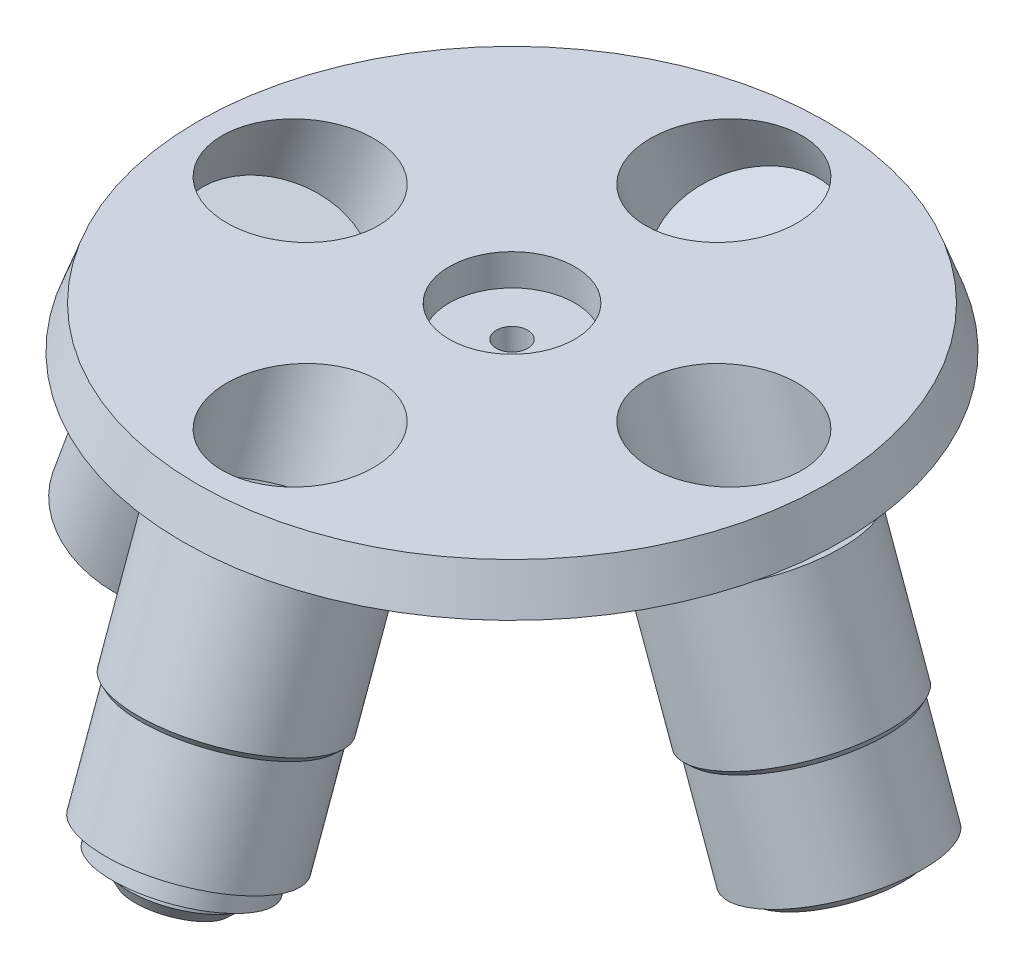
ISO-10303-21;
HEADER;
FILE_DESCRIPTION(('STEP AP214'),'2;1');
FILE_NAME('part.step','',(''),(''),'','','');
FILE_SCHEMA(('AUTOMOTIVE_DESIGN { 1 0 10303 214 1 1 1 1 }'));
ENDSEC;
DATA;
#1=APPLICATION_CONTEXT('core data for automotive mechanical design processes');
#2=APPLICATION_PROTOCOL_DEFINITION('international standard','automotive_design',2000,#1);
#3=PRODUCT_CONTEXT('',#1,'mechanical');
#4=PRODUCT('Part','Part','',(#3));
#5=PRODUCT_RELATED_PRODUCT_CATEGORY('part','',(#4));
#6=PRODUCT_DEFINITION_FORMATION('','',#4);
#7=PRODUCT_DEFINITION_CONTEXT('part definition',#1,'design');
#8=PRODUCT_DEFINITION('design','',#6,#7);
#9=PRODUCT_DEFINITION_SHAPE('','',#8);
#10=(LENGTH_UNIT() NAMED_UNIT(*) SI_UNIT(.MILLI.,.METRE.));
#11=(NAMED_UNIT(*) PLANE_ANGLE_UNIT() SI_UNIT($,.RADIAN.));
#12=(NAMED_UNIT(*) SI_UNIT($,.STERADIAN.) SOLID_ANGLE_UNIT());
#13=UNCERTAINTY_MEASURE_WITH_UNIT(LENGTH_MEASURE(1.E-05),#10,'distance_accuracy_value','');
#14=(GEOMETRIC_REPRESENTATION_CONTEXT(3) GLOBAL_UNCERTAINTY_ASSIGNED_CONTEXT((#13)) GLOBAL_UNIT_ASSIGNED_CONTEXT((#10,
#11,#12)) REPRESENTATION_CONTEXT('',''));
#15=CARTESIAN_POINT('',(0.,0.,0.));
#16=DIRECTION('',(0.,0.,1.));
#17=DIRECTION('',(1.,0.,0.));
#18=AXIS2_PLACEMENT_3D('',#15,#16,#17);
#19=CARTESIAN_POINT('',(31.1929453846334,-30.1496294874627,0.));
#20=DIRECTION('',(0.342020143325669,-0.939692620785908,0.));
#21=DIRECTION('',(0.939692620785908,0.342020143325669,0.));
#22=AXIS2_PLACEMENT_3D('',#19,#20,#21);
#23=PLANE('',#22);
#24=CARTESIAN_POINT('',(31.1929453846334,-30.1496294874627,0.));
#25=DIRECTION('',(0.342020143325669,-0.939692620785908,0.));
#26=DIRECTION('',(0.939692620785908,0.342020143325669,0.));
#27=AXIS2_PLACEMENT_3D('',#24,#25,#26);
#28=CIRCLE('',#27,8.5);
#29=CARTESIAN_POINT('',(39.1803326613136,-27.2424582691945,0.));
#30=VERTEX_POINT('',#29);
#31=EDGE_CURVE('E65',#30,#30,#28,.T.);
#32=ORIENTED_EDGE('',*,*,#31,.T.);
#33=EDGE_LOOP('',(#32));
#34=FACE_BOUND('',#33,.T.);
#35=CARTESIAN_POINT('',(31.1929453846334,-30.1496294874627,0.281028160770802));
#36=DIRECTION('',(0.342020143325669,-0.939692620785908,0.));
#37=DIRECTION('',(0.939692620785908,0.342020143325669,0.));
#38=AXIS2_PLACEMENT_3D('',#35,#36,#37);
#39=CIRCLE('',#38,7.5);
#40=CARTESIAN_POINT('',(38.2406400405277,-27.5844784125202,0.281028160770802));
#41=VERTEX_POINT('',#40);
#42=EDGE_CURVE('E315',#41,#41,#39,.T.);
#43=ORIENTED_EDGE('',*,*,#42,.F.);
#44=EDGE_LOOP('',(#43));
#45=FACE_BOUND('',#44,.T.);
#46=ADVANCED_FACE('F26',(#34,#45),#23,.T.);
#47=CARTESIAN_POINT('',(0.,-31.0893221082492,31.5349655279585));
#48=DIRECTION('',(0.,-0.939692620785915,0.342020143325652));
#49=DIRECTION('',(0.,-0.342020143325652,-0.939692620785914));
#50=AXIS2_PLACEMENT_3D('',#47,#48,#49);
#51=PLANE('',#50);
#52=CARTESIAN_POINT('',(0.,-31.0893221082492,31.5349655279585));
#53=DIRECTION('',(0.,-0.939692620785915,0.342020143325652));
#54=DIRECTION('',(0.,-0.342020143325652,-0.939692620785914));
#55=AXIS2_PLACEMENT_3D('',#52,#53,#54);
#56=CIRCLE('',#55,7.);
#57=CARTESIAN_POINT('',(0.,-33.4834631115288,24.9571171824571));
#58=VERTEX_POINT('',#57);
#59=EDGE_CURVE('E340',#58,#58,#56,.T.);
#60=ORIENTED_EDGE('',*,*,#59,.T.);
#61=EDGE_LOOP('',(#60));
#62=FACE_BOUND('',#61,.T.);
#63=CARTESIAN_POINT('',(0.,-31.0893221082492,31.5349655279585));
#64=DIRECTION('',(0.,-0.939692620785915,0.342020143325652));
#65=DIRECTION('',(0.,-0.342020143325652,-0.939692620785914));
#66=AXIS2_PLACEMENT_3D('',#63,#64,#65);
#67=CIRCLE('',#66,5.);
#68=CARTESIAN_POINT('',(0.,-32.7994228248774,26.8365024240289));
#69=VERTEX_POINT('',#68);
#70=EDGE_CURVE('E334',#69,#69,#67,.T.);
#71=ORIENTED_EDGE('',*,*,#70,.F.);
#72=EDGE_LOOP('',(#71));
#73=FACE_BOUND('',#72,.T.);
#74=ADVANCED_FACE('F138',(#62,#73),#51,.T.);
#75=CARTESIAN_POINT('',(0.,-29.2099368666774,30.8509252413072));
#76=DIRECTION('',(0.,-0.939692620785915,0.342020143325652));
#77=DIRECTION('',(0.,-0.342020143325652,-0.939692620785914));
#78=AXIS2_PLACEMENT_3D('',#75,#76,#77);
#79=PLANE('',#78);
#80=CARTESIAN_POINT('',(0.,-29.2099368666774,30.8509252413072));
#81=DIRECTION('',(0.,-0.939692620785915,0.342020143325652));
#82=DIRECTION('',(0.,-0.342020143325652,-0.939692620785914));
#83=AXIS2_PLACEMENT_3D('',#80,#81,#82);
#84=CIRCLE('',#83,8.5);
#85=CARTESIAN_POINT('',(0.,-32.1171080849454,22.8635379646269));
#86=VERTEX_POINT('',#85);
#87=EDGE_CURVE('E216',#86,#86,#84,.T.);
#88=ORIENTED_EDGE('',*,*,#87,.T.);
#89=EDGE_LOOP('',(#88));
#90=FACE_BOUND('',#89,.T.);
#91=CARTESIAN_POINT('',(0.,-29.2099368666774,30.8509252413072));
#92=DIRECTION('',(0.,-0.939692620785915,0.342020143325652));
#93=DIRECTION('',(0.,-0.342020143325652,-0.939692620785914));
#94=AXIS2_PLACEMENT_3D('',#91,#92,#93);
#95=CIRCLE('',#94,7.);
#96=CARTESIAN_POINT('',(0.,-31.6040778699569,24.2730768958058));
#97=VERTEX_POINT('',#96);
#98=EDGE_CURVE('E337',#97,#97,#95,.T.);
#99=ORIENTED_EDGE('',*,*,#98,.F.);
#100=EDGE_LOOP('',(#99));
#101=FACE_BOUND('',#100,.T.);
#102=ADVANCED_FACE('F146',(#90,#101),#79,.T.);
#103=CARTESIAN_POINT('',(-33.2450662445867,-35.7877852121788,0.));
#104=DIRECTION('',(-0.342020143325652,-0.939692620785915,0.));
#105=DIRECTION('',(0.939692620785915,-0.342020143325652,0.));
#106=AXIS2_PLACEMENT_3D('',#103,#104,#105);
#107=PLANE('',#106);
#108=CARTESIAN_POINT('',(-33.2450662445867,-35.7877852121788,0.));
#109=DIRECTION('',(-0.342020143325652,-0.939692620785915,0.));
#110=DIRECTION('',(0.939692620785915,-0.342020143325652,0.));
#111=AXIS2_PLACEMENT_3D('',#108,#109,#110);
#112=CIRCLE('',#111,6.);
#113=CARTESIAN_POINT('',(-27.6069105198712,-37.8399060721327,0.));
#114=VERTEX_POINT('',#113);
#115=EDGE_CURVE('E229',#114,#114,#112,.T.);
#116=ORIENTED_EDGE('',*,*,#115,.T.);
#117=EDGE_LOOP('',(#116));
#118=FACE_BOUND('',#117,.T.);
#119=CARTESIAN_POINT('',(-33.2450662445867,-35.7877852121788,0.));
#120=DIRECTION('',(-0.342020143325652,-0.939692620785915,0.));
#121=DIRECTION('',(0.939692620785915,-0.342020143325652,0.));
#122=AXIS2_PLACEMENT_3D('',#119,#120,#121);
#123=CIRCLE('',#122,5.);
#124=CARTESIAN_POINT('',(-28.5466031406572,-37.4978859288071,0.));
#125=VERTEX_POINT('',#124);
#126=EDGE_CURVE('E223',#125,#125,#123,.T.);
#127=ORIENTED_EDGE('',*,*,#126,.F.);
#128=EDGE_LOOP('',(#127));
#129=FACE_BOUND('',#128,.T.);
#130=ADVANCED_FACE('F192',(#118,#129),#107,.T.);
#131=CARTESIAN_POINT('',(-32.9030461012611,-34.8480925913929,0.));
#132=DIRECTION('',(-0.342020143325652,-0.939692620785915,0.));
#133=DIRECTION('',(0.939692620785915,-0.342020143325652,0.));
#134=AXIS2_PLACEMENT_3D('',#131,#132,#133);
#135=PLANE('',#134);
#136=CARTESIAN_POINT('',(-32.9030461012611,-34.8480925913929,0.));
#137=DIRECTION('',(-0.342020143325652,-0.939692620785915,0.));
#138=DIRECTION('',(0.939692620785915,-0.342020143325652,0.));
#139=AXIS2_PLACEMENT_3D('',#136,#137,#138);
#140=CIRCLE('',#139,7.);
#141=CARTESIAN_POINT('',(-26.3251977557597,-37.2422335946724,0.));
#142=VERTEX_POINT('',#141);
#143=EDGE_CURVE('E235',#142,#142,#140,.T.);
#144=ORIENTED_EDGE('',*,*,#143,.T.);
#145=EDGE_LOOP('',(#144));
#146=FACE_BOUND('',#145,.T.);
#147=CARTESIAN_POINT('',(-32.9030461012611,-34.8480925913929,0.));
#148=DIRECTION('',(-0.342020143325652,-0.939692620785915,0.));
#149=DIRECTION('',(0.939692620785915,-0.342020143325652,0.));
#150=AXIS2_PLACEMENT_3D('',#147,#148,#149);
#151=CIRCLE('',#150,6.);
#152=CARTESIAN_POINT('',(-27.2648903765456,-36.9002134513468,0.));
#153=VERTEX_POINT('',#152);
#154=EDGE_CURVE('E226',#153,#153,#151,.T.);
#155=ORIENTED_EDGE('',*,*,#154,.F.);
#156=EDGE_LOOP('',(#155));
#157=FACE_BOUND('',#156,.T.);
#158=ADVANCED_FACE('F133',(#146,#157),#135,.T.);
#159=CARTESIAN_POINT('',(-32.5610259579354,-33.908399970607,0.));
#160=DIRECTION('',(-0.342020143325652,-0.939692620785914,0.));
#161=DIRECTION('',(0.939692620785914,-0.342020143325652,0.));
#162=AXIS2_PLACEMENT_3D('',#159,#160,#161);
#163=PLANE('',#162);
#164=CARTESIAN_POINT('',(-32.5610259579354,-33.908399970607,0.));
#165=DIRECTION('',(-0.342020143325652,-0.939692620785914,0.));
#166=DIRECTION('',(0.939692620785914,-0.342020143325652,0.));
#167=AXIS2_PLACEMENT_3D('',#164,#165,#166);
#168=CIRCLE('',#167,8.5);
#169=CARTESIAN_POINT('',(-24.5736386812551,-36.815571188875,0.));
#170=VERTEX_POINT('',#169);
#171=EDGE_CURVE('E241',#170,#170,#168,.T.);
#172=ORIENTED_EDGE('',*,*,#171,.T.);
#173=EDGE_LOOP('',(#172));
#174=FACE_BOUND('',#173,.T.);
#175=CARTESIAN_POINT('',(-32.5610259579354,-33.908399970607,0.));
#176=DIRECTION('',(-0.342020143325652,-0.939692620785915,0.));
#177=DIRECTION('',(0.939692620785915,-0.342020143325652,0.));
#178=AXIS2_PLACEMENT_3D('',#175,#176,#177);
#179=CIRCLE('',#178,7.);
#180=CARTESIAN_POINT('',(-25.983177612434,-36.3025409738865,0.));
#181=VERTEX_POINT('',#180);
#182=EDGE_CURVE('E232',#181,#181,#179,.T.);
#183=ORIENTED_EDGE('',*,*,#182,.F.);
#184=EDGE_LOOP('',(#183));
#185=FACE_BOUND('',#184,.T.);
#186=ADVANCED_FACE('F126',(#174,#185),#163,.T.);
#187=CARTESIAN_POINT('',(0.,0.,0.));
#188=DIRECTION('',(0.,-1.,0.));
#189=DIRECTION('',(0.,0.,1.));
#190=AXIS2_PLACEMENT_3D('',#187,#188,#189);
#191=CONICAL_SURFACE('',#190,30.,0.349065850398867);
#192=CARTESIAN_POINT('',(0.,-4.,0.));
#193=DIRECTION('',(0.,1.,0.));
#194=DIRECTION('',(0.,0.,1.));
#195=AXIS2_PLACEMENT_3D('',#192,#193,#194);
#196=CIRCLE('',#195,31.4558809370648);
#197=CARTESIAN_POINT('',(0.,-4.,31.4558809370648));
#198=VERTEX_POINT('',#197);
#199=EDGE_CURVE('E69',#198,#198,#196,.T.);
#200=ORIENTED_EDGE('',*,*,#199,.T.);
#201=EDGE_LOOP('',(#200));
#202=FACE_BOUND('',#201,.T.);
#203=CARTESIAN_POINT('',(0.,0.,0.));
#204=DIRECTION('',(0.,1.,0.));
#205=DIRECTION('',(0.,0.,1.));
#206=AXIS2_PLACEMENT_3D('',#203,#204,#205);
#207=CIRCLE('',#206,30.);
#208=CARTESIAN_POINT('',(0.,0.,30.));
#209=VERTEX_POINT('',#208);
#210=EDGE_CURVE('E75',#209,#209,#207,.T.);
#211=ORIENTED_EDGE('',*,*,#210,.F.);
#212=EDGE_LOOP('',(#211));
#213=FACE_BOUND('',#212,.T.);
#214=ADVANCED_FACE('F124',(#202,#213),#191,.T.);
#215=CARTESIAN_POINT('',(0.,40.4736222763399,0.));
#216=DIRECTION('',(0.,0.,1.));
#217=DIRECTION('',(1.,0.,0.));
#218=AXIS2_PLACEMENT_3D('',#215,#216,#217);
#219=SPHERICAL_SURFACE('',#218,54.4736222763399);
#220=CARTESIAN_POINT('',(-5.97622342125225,-10.9221212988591,17.0334324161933));
#221=CARTESIAN_POINT('',(-5.7878349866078,-10.9943243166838,16.8816686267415));
#222=CARTESIAN_POINT('',(-5.59240356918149,-11.0631085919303,16.7370743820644));
#223=CARTESIAN_POINT('',(-5.18871432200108,-11.1933921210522,16.4631749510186));
#224=CARTESIAN_POINT('',(-4.98045327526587,-11.2548895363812,16.333873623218));
#225=CARTESIAN_POINT('',(-4.55240666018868,-11.370191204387,16.0914268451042));
#226=CARTESIAN_POINT('',(-4.33260948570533,-11.4239874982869,15.9782981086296));
#227=CARTESIAN_POINT('',(-3.88323408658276,-11.5234269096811,15.7691718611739));
#228=CARTESIAN_POINT('',(-3.65365577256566,-11.569069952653,15.6731745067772));
#229=CARTESIAN_POINT('',(-3.1864282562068,-11.6518581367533,15.4990431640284));
#230=CARTESIAN_POINT('',(-2.94878180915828,-11.6890061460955,15.4209031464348));
#231=CARTESIAN_POINT('',(-2.46702997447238,-11.7545558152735,15.2830150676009));
#232=CARTESIAN_POINT('',(-2.22292448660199,-11.7829573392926,15.223267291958));
#233=CARTESIAN_POINT('',(-1.73010309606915,-11.8307970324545,15.1226248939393));
#234=CARTESIAN_POINT('',(-1.48138919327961,-11.85023899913,15.0817222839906));
#235=CARTESIAN_POINT('',(-0.980938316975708,-11.8800413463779,15.0190222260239));
#236=CARTESIAN_POINT('',(-0.72920032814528,-11.8903985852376,14.9972313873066));
#237=CARTESIAN_POINT('',(-0.225162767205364,-11.9019315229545,14.9729669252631));
#238=CARTESIAN_POINT('',(0.0271342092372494,-11.9031281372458,14.9704492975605));
#239=CARTESIAN_POINT('',(0.531068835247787,-11.8963861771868,14.9846339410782));
#240=CARTESIAN_POINT('',(0.782706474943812,-11.8884474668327,15.0013364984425));
#241=CARTESIAN_POINT('',(1.28352974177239,-11.863491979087,15.0538399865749));
#242=CARTESIAN_POINT('',(1.53271534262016,-11.8464751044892,15.0896411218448));
#243=CARTESIAN_POINT('',(2.02686530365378,-11.8034858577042,15.1800810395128));
#244=CARTESIAN_POINT('',(2.27182956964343,-11.7775132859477,15.2347202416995));
#245=CARTESIAN_POINT('',(2.7556055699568,-11.71682375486,15.3623878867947));
#246=CARTESIAN_POINT('',(2.99442189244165,-11.6821135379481,15.4354021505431));
#247=CARTESIAN_POINT('',(3.46449005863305,-11.6041751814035,15.5993379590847));
#248=CARTESIAN_POINT('',(3.69573926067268,-11.5609441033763,15.6902656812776));
#249=CARTESIAN_POINT('',(4.14891445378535,-11.4662906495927,15.8893346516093));
#250=CARTESIAN_POINT('',(4.37084210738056,-11.4148697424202,15.9974728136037));
#251=CARTESIAN_POINT('',(4.80386259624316,-11.3041981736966,16.2301946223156));
#252=CARTESIAN_POINT('',(5.01495522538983,-11.2449473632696,16.3547785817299));
#253=CARTESIAN_POINT('',(5.42527709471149,-11.1189000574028,16.619786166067));
#254=CARTESIAN_POINT('',(5.62447907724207,-11.0520871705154,16.7602441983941));
#255=CARTESIAN_POINT('',(6.0091214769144,-10.9114975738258,17.0557674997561));
#256=CARTESIAN_POINT('',(6.19456157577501,-10.8377207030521,17.210833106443));
#257=CARTESIAN_POINT('',(6.5503522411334,-10.6837423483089,17.534428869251));
#258=CARTESIAN_POINT('',(6.72070541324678,-10.6035419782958,17.7029566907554));
#259=CARTESIAN_POINT('',(7.04523412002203,-10.4372441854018,18.0523589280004));
#260=CARTESIAN_POINT('',(7.19940393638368,-10.3511446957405,18.2332376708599));
#261=CARTESIAN_POINT('',(7.49097053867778,-10.1733534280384,18.6066921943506));
#262=CARTESIAN_POINT('',(7.6283032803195,-10.081642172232,18.7993087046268));
#263=CARTESIAN_POINT('',(7.88463646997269,-9.89352359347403,19.1943472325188));
#264=CARTESIAN_POINT('',(8.0036285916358,-9.79711416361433,19.3967736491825));
#265=CARTESIAN_POINT('',(8.22238688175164,-9.60031691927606,19.8099169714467));
#266=CARTESIAN_POINT('',(8.32215268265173,-9.49992902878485,20.020634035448));
#267=CARTESIAN_POINT('',(8.50172939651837,-9.29592984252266,20.4487668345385));
#268=CARTESIAN_POINT('',(8.58154920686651,-9.19232000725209,20.666179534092));
#269=CARTESIAN_POINT('',(8.72106919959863,-8.98207417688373,21.1072836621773));
#270=CARTESIAN_POINT('',(8.78067422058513,-8.87542636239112,21.3309995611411));
#271=CARTESIAN_POINT('',(8.87882315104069,-8.66036058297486,21.782069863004));
#272=CARTESIAN_POINT('',(8.91737433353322,-8.55194324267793,22.0094229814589));
#273=CARTESIAN_POINT('',(8.97318844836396,-8.33404629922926,22.4662801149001));
#274=CARTESIAN_POINT('',(8.99044712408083,-8.22456648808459,22.695784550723));
#275=CARTESIAN_POINT('',(9.00354415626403,-8.00534189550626,23.1552712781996));
#276=CARTESIAN_POINT('',(8.99938296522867,-7.89559711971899,23.3852535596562));
#277=CARTESIAN_POINT('',(8.96963211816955,-7.67633196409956,23.8446703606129));
#278=CARTESIAN_POINT('',(8.94398699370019,-7.56681290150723,24.0741019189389));
#279=CARTESIAN_POINT('',(8.87137431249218,-7.34906647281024,24.5301825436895));
#280=CARTESIAN_POINT('',(8.82440708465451,-7.24083908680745,24.7568316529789));
#281=CARTESIAN_POINT('',(8.7094650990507,-7.02642548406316,25.2057811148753));
#282=CARTESIAN_POINT('',(8.64148640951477,-6.9202396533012,25.428080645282));
#283=CARTESIAN_POINT('',(8.4850236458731,-6.71072588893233,25.8666259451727));
#284=CARTESIAN_POINT('',(8.39654672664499,-6.60739697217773,26.0828737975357));
#285=CARTESIAN_POINT('',(8.19969869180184,-6.40430870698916,26.5078326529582));
#286=CARTESIAN_POINT('',(8.09132939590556,-6.30454903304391,26.7165443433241));
#287=CARTESIAN_POINT('',(7.85544943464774,-6.10930962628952,27.1249521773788));
#288=CARTESIAN_POINT('',(7.72793919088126,-6.01382979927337,27.3246485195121));
#289=CARTESIAN_POINT('',(7.45466633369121,-5.82783720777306,27.7135970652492));
#290=CARTESIAN_POINT('',(7.30890351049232,-5.73732450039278,27.9028491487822));
#291=CARTESIAN_POINT('',(7.00015386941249,-5.56192696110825,28.2695368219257));
#292=CARTESIAN_POINT('',(6.83716739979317,-5.47704201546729,28.4469726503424));
#293=CARTESIAN_POINT('',(6.49561509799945,-5.31375563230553,28.7882492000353));
#294=CARTESIAN_POINT('',(6.31709580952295,-5.23533610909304,28.9521278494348));
#295=CARTESIAN_POINT('',(5.94539893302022,-5.0853063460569,29.2656196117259));
#296=CARTESIAN_POINT('',(5.75222654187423,-5.01369371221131,29.4152377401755));
#297=CARTESIAN_POINT('',(5.35250447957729,-4.87776138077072,29.6992079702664));
#298=CARTESIAN_POINT('',(5.14595270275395,-4.81344283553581,29.8335576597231));
#299=CARTESIAN_POINT('',(4.72096922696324,-4.69258654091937,30.0859815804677));
#300=CARTESIAN_POINT('',(4.50253756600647,-4.6360487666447,30.2040558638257));
#301=CARTESIAN_POINT('',(4.05637769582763,-4.53141291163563,30.4225619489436));
#302=CARTESIAN_POINT('',(3.82869650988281,-4.48327745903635,30.5230718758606));
#303=CARTESIAN_POINT('',(3.36472916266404,-4.39548718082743,30.7063719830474));
#304=CARTESIAN_POINT('',(3.12844303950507,-4.35583231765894,30.7891622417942));
#305=CARTESIAN_POINT('',(2.64895615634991,-4.2852976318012,30.9364151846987));
#306=CARTESIAN_POINT('',(2.40575552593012,-4.25441764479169,31.0008782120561));
#307=CARTESIAN_POINT('',(1.91417632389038,-4.20166137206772,31.1110048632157));
#308=CARTESIAN_POINT('',(1.66579776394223,-4.17978506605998,31.1566685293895));
#309=CARTESIAN_POINT('',(1.1666882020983,-4.14527127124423,31.2287096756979));
#310=CARTESIAN_POINT('',(0.915971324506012,-4.13259564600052,31.2551667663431));
#311=CARTESIAN_POINT('',(0.412868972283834,-4.11642576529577,31.2889170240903));
#312=CARTESIAN_POINT('',(0.160482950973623,-4.11293468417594,31.2962035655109));
#313=CARTESIAN_POINT('',(-0.344021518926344,-4.11516874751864,31.2915406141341));
#314=CARTESIAN_POINT('',(-0.596140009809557,-4.12089211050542,31.279594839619));
#315=CARTESIAN_POINT('',(-1.09836426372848,-4.14150945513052,31.2365613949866));
#316=CARTESIAN_POINT('',(-1.34846999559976,-4.15640357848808,31.2054734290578));
#317=CARTESIAN_POINT('',(-1.84448288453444,-4.1952209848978,31.1244481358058));
#318=CARTESIAN_POINT('',(-2.09039614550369,-4.21912971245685,31.074541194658));
#319=CARTESIAN_POINT('',(-2.57669717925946,-4.2758029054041,30.956235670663));
#320=CARTESIAN_POINT('',(-2.81708483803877,-4.3085675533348,30.8878367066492));
#321=CARTESIAN_POINT('',(-3.29058543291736,-4.38270480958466,30.733058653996));
#322=CARTESIAN_POINT('',(-3.52369969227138,-4.42407584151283,30.6466828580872));
#323=CARTESIAN_POINT('',(-3.98113538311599,-4.51514239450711,30.456535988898));
#324=CARTESIAN_POINT('',(-4.20545374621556,-4.56484078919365,30.3527589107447));
#325=CARTESIAN_POINT('',(-4.64393300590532,-4.67226230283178,30.1284273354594));
#326=CARTESIAN_POINT('',(-4.85807972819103,-4.72999620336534,30.0078502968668));
#327=CARTESIAN_POINT('',(-5.27439248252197,-4.85301860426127,29.7508916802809));
#328=CARTESIAN_POINT('',(-5.47655821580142,-4.918307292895,29.6145097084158));
#329=CARTESIAN_POINT('',(-5.86749137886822,-5.05596524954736,29.3269219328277));
#330=CARTESIAN_POINT('',(-6.05625877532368,-5.12833453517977,29.1757160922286));
#331=CARTESIAN_POINT('',(-6.41908237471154,-5.27963202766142,28.8595607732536));
#332=CARTESIAN_POINT('',(-6.59313853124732,-5.35856025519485,28.6946112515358));
#333=CARTESIAN_POINT('',(-6.9259923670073,-5.52273422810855,28.3514632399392));
#334=CARTESIAN_POINT('',(-7.08472694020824,-5.60800373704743,28.1732149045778));
#335=CARTESIAN_POINT('',(-7.3850485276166,-5.78396891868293,27.8053225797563));
#336=CARTESIAN_POINT('',(-7.52663582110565,-5.87466450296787,27.615678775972));
#337=CARTESIAN_POINT('',(-7.79171409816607,-6.06085357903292,27.2263001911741));
#338=CARTESIAN_POINT('',(-7.9152014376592,-6.15634803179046,27.0265633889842));
#339=CARTESIAN_POINT('',(-8.14315648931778,-6.35140511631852,26.6185169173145));
#340=CARTESIAN_POINT('',(-8.24763063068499,-6.45096635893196,26.4102101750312));
#341=CARTESIAN_POINT('',(-8.43734598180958,-6.65396591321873,25.9854164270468));
#342=CARTESIAN_POINT('',(-8.52249311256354,-6.75742044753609,25.7688951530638));
#343=CARTESIAN_POINT('',(-8.67232504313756,-6.96701711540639,25.3301550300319));
#344=CARTESIAN_POINT('',(-8.73701023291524,-7.0731591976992,25.1079362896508));
#345=CARTESIAN_POINT('',(-8.84547482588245,-7.28737962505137,24.659369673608));
#346=CARTESIAN_POINT('',(-8.88925430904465,-7.39545796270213,24.4330218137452));
#347=CARTESIAN_POINT('',(-8.95560601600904,-7.61278496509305,23.9777980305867));
#348=CARTESIAN_POINT('',(-8.97817852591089,-7.72203361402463,23.7489221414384));
#349=CARTESIAN_POINT('',(-9.00200011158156,-7.94128575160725,23.2895112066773));
#350=CARTESIAN_POINT('',(-9.0031799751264,-8.05129053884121,23.0589731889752));
#351=CARTESIAN_POINT('',(-8.98403357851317,-8.27088431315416,22.5986909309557));
#352=CARTESIAN_POINT('',(-8.96371470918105,-8.38047343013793,22.3689464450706));
#353=CARTESIAN_POINT('',(-8.9017082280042,-8.59854441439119,21.9117027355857));
#354=CARTESIAN_POINT('',(-8.8600113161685,-8.70702577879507,21.684204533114));
#355=CARTESIAN_POINT('',(-8.75553216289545,-8.92206056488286,21.2331778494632));
#356=CARTESIAN_POINT('',(-8.69275026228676,-9.0286140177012,21.0096493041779));
#357=CARTESIAN_POINT('',(-8.54647005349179,-9.23913093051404,20.5679556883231));
#358=CARTESIAN_POINT('',(-8.46295341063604,-9.34309200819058,20.349795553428));
#359=CARTESIAN_POINT('',(-8.27581502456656,-9.54758223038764,19.9206116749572));
#360=CARTESIAN_POINT('',(-8.17219356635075,-9.64811142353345,19.7095878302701));
#361=CARTESIAN_POINT('',(-7.94568529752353,-9.84491695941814,19.2964072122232));
#362=CARTESIAN_POINT('',(-7.82281918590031,-9.94119773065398,19.0942412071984));
#363=CARTESIAN_POINT('',(-7.55865023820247,-10.1288997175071,18.7000587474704));
#364=CARTESIAN_POINT('',(-7.41735226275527,-10.2203222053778,18.5080396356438));
#365=CARTESIAN_POINT('',(-7.0783325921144,-10.4206954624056,18.0871315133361));
#366=CARTESIAN_POINT('',(-6.87547942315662,-10.5280464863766,17.8615884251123));
#367=CARTESIAN_POINT('',(-6.44429386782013,-10.7328175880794,17.4313041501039));
#368=CARTESIAN_POINT('',(-6.21596149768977,-10.8302376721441,17.2265629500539));
#369=CARTESIAN_POINT('',(-5.97622342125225,-10.9221212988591,17.0334324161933));
#370=B_SPLINE_CURVE_WITH_KNOTS('',3,(#220,#221,#222,#223,#224,#225,#226,#227,#228,#229,#230,
#231,#232,#233,#234,#235,#236,#237,#238,#239,#240,#241,#242,#243,#244,#245,#246,#247,#248,#249,
#250,#251,#252,#253,#254,#255,#256,#257,#258,#259,#260,#261,#262,#263,#264,#265,#266,#267,#268,
#269,#270,#271,#272,#273,#274,#275,#276,#277,#278,#279,#280,#281,#282,#283,#284,#285,#286,#287,
#288,#289,#290,#291,#292,#293,#294,#295,#296,#297,#298,#299,#300,#301,#302,#303,#304,#305,#306,
#307,#308,#309,#310,#311,#312,#313,#314,#315,#316,#317,#318,#319,#320,#321,#322,#323,#324,#325,
#326,#327,#328,#329,#330,#331,#332,#333,#334,#335,#336,#337,#338,#339,#340,#341,#342,#343,#344,
#345,#346,#347,#348,#349,#350,#351,#352,#353,#354,#355,#356,#357,#358,#359,#360,#361,#362,#363,
#364,#365,#366,#367,#368,#369),.UNSPECIFIED.,.T.,.F.,(4,2,2,2,2,2,2,2,2,2,2,2,2,2,2,2,2,2,2,2,2,
2,2,2,2,2,2,2,2,2,2,2,2,2,2,2,2,2,2,2,2,2,2,2,2,2,2,2,2,2,2,2,2,2,2,2,2,2,2,2,2,2,2,2,2,2,2,2,2,
2,2,2,2,2,4),(0.,0.757099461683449,1.51438954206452,2.27245668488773,3.03053075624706,
3.78834849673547,4.5461780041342,5.30368600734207,6.06145587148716,6.81749508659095,
7.5735455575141,8.32960412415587,9.08567953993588,9.84117330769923,10.596928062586,
11.3525474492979,12.1081812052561,12.8654854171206,13.6228071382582,14.3799978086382,
15.1374551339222,15.897709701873,16.6583084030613,17.418921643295,18.1791949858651,
18.9429991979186,19.7065393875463,20.4702321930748,21.23390886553,21.999563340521,
22.7652060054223,23.5309920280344,24.2965111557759,25.0619602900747,25.827392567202,
26.5928336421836,27.3582592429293,28.1214654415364,28.8844022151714,29.6474593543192,
30.4105140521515,31.170083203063,31.9296489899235,32.6892005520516,33.4487504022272,
34.2051336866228,34.9617783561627,35.7182767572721,36.4747868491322,37.2300806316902,
37.9853899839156,38.7405611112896,39.4959933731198,40.2524491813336,41.0089238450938,
41.7654003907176,42.5218793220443,43.2813517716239,44.0408118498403,44.8004246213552,
45.5597800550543,46.3227561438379,47.0857176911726,47.8486763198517,48.6116246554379,
49.3770409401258,50.1421941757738,50.9076805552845,51.6731545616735,52.439307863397,
53.2054503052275,53.9707742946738,54.7358968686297,55.6993619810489,56.6628264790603),.UNSPECIFIED.);
#371=CARTESIAN_POINT('',(-5.97622342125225,-10.9221212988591,17.0334324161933));
#372=VERTEX_POINT('',#371);
#373=EDGE_CURVE('E209',#372,#372,#370,.T.);
#374=ORIENTED_EDGE('',*,*,#373,.F.);
#375=EDGE_LOOP('',(#374));
#376=FACE_BOUND('',#375,.T.);
#377=CARTESIAN_POINT('',(-8.98263523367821,-7.77256834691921,-23.6430302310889));
#378=CARTESIAN_POINT('',(-8.96688805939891,-7.66301747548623,-23.872564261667));
#379=CARTESIAN_POINT('',(-8.94043235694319,-7.55375013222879,-24.1014653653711));
#380=CARTESIAN_POINT('',(-8.86628025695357,-7.33649535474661,-24.5565101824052));
#381=CARTESIAN_POINT('',(-8.81857830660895,-7.22850826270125,-24.7826531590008));
#382=CARTESIAN_POINT('',(-8.70219884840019,-7.01450490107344,-25.2307380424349));
#383=CARTESIAN_POINT('',(-8.63349899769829,-6.90849085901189,-25.4526752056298));
#384=CARTESIAN_POINT('',(-8.47561694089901,-6.69930602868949,-25.8905267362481));
#385=CARTESIAN_POINT('',(-8.38643454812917,-6.59613526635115,-26.1064410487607));
#386=CARTESIAN_POINT('',(-8.18824434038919,-6.39341576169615,-26.5306233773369));
#387=CARTESIAN_POINT('',(-8.07924392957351,-6.29386568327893,-26.7388942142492));
#388=CARTESIAN_POINT('',(-7.84215262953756,-6.09906106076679,-27.1463880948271));
#389=CARTESIAN_POINT('',(-7.7140614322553,-6.00380658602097,-27.3456109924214));
#390=CARTESIAN_POINT('',(-7.4397504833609,-5.81832718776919,-27.7334823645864));
#391=CARTESIAN_POINT('',(-7.29353936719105,-5.72809989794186,-27.9221358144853));
#392=CARTESIAN_POINT('',(-6.98389983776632,-5.55324322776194,-28.2876893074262));
#393=CARTESIAN_POINT('',(-6.82046412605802,-5.46861624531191,-28.4645843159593));
#394=CARTESIAN_POINT('',(-6.47796360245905,-5.30580270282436,-28.8048696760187));
#395=CARTESIAN_POINT('',(-6.29893462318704,-5.22760213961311,-28.9682893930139));
#396=CARTESIAN_POINT('',(-5.92627771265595,-5.07803421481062,-29.2808136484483));
#397=CARTESIAN_POINT('',(-5.73265611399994,-5.00666391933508,-29.4299243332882));
#398=CARTESIAN_POINT('',(-5.33206937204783,-4.87122610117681,-29.7128594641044));
#399=CARTESIAN_POINT('',(-5.12510106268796,-4.80716032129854,-29.8466802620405));
#400=CARTESIAN_POINT('',(-4.69933553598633,-4.68682420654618,-30.0980161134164));
#401=CARTESIAN_POINT('',(-4.48053836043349,-4.63055384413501,-30.2155312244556));
#402=CARTESIAN_POINT('',(-4.0337077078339,-4.52646540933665,-30.4328929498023));
#403=CARTESIAN_POINT('',(-3.80572123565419,-4.47860972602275,-30.5328181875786));
#404=CARTESIAN_POINT('',(-3.34119900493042,-4.39138910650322,-30.714928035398));
#405=CARTESIAN_POINT('',(-3.10466327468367,-4.35202414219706,-30.7971127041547));
#406=CARTESIAN_POINT('',(-2.62473562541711,-4.28207740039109,-30.9431376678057));
#407=CARTESIAN_POINT('',(-2.3813438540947,-4.25149543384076,-31.0069783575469));
#408=CARTESIAN_POINT('',(-1.88944156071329,-4.19934099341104,-31.1158484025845));
#409=CARTESIAN_POINT('',(-1.64093105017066,-4.17776849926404,-31.1608778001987));
#410=CARTESIAN_POINT('',(-1.1416141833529,-4.14386431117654,-31.2316463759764));
#411=CARTESIAN_POINT('',(-0.890821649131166,-4.13149460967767,-31.2574648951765));
#412=CARTESIAN_POINT('',(-0.387627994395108,-4.11593820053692,-31.2899346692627));
#413=CARTESIAN_POINT('',(-0.135226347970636,-4.11275466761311,-31.2965792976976));
#414=CARTESIAN_POINT('',(0.369248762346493,-4.11560300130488,-31.2906342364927));
#415=CARTESIAN_POINT('',(0.621322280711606,-4.12163306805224,-31.2780483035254));
#416=CARTESIAN_POINT('',(1.12339695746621,-4.14286075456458,-31.2337408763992));
#417=CARTESIAN_POINT('',(1.37339808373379,-4.15805851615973,-31.2020190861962));
#418=CARTESIAN_POINT('',(1.86914949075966,-4.19747790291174,-31.1197370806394));
#419=CARTESIAN_POINT('',(2.11490587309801,-4.22168520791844,-31.0692067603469));
#420=CARTESIAN_POINT('',(2.60083566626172,-4.27894854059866,-30.9496689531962));
#421=CARTESIAN_POINT('',(2.8410089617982,-4.31200475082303,-30.8806610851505));
#422=CARTESIAN_POINT('',(3.31402546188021,-4.3867160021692,-30.724684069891));
#423=CARTESIAN_POINT('',(3.54686998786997,-4.42836948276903,-30.6377181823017));
#424=CARTESIAN_POINT('',(4.00371263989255,-4.5199899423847,-30.4464138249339));
#425=CARTESIAN_POINT('',(4.22770766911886,-4.56995980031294,-30.3420693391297));
#426=CARTESIAN_POINT('',(4.66549443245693,-4.67791301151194,-30.1166261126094));
#427=CARTESIAN_POINT('',(4.8792716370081,-4.7359073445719,-29.9955044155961));
#428=CARTESIAN_POINT('',(5.29479495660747,-4.85943577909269,-29.737487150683));
#429=CARTESIAN_POINT('',(5.49654083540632,-4.92497002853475,-29.6005912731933));
#430=CARTESIAN_POINT('',(5.88658618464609,-5.06310207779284,-29.3120109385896));
#431=CARTESIAN_POINT('',(6.07488576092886,-5.13569982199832,-29.1603265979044));
#432=CARTESIAN_POINT('',(6.43673530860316,-5.28743787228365,-28.8432481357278));
#433=CARTESIAN_POINT('',(6.61028491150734,-5.36657834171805,-28.6778536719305));
#434=CARTESIAN_POINT('',(6.94205640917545,-5.5311446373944,-28.3338826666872));
#435=CARTESIAN_POINT('',(7.1002177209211,-5.61659314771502,-28.1552585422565));
#436=CARTESIAN_POINT('',(7.39941417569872,-5.79292419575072,-27.7865979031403));
#437=CARTESIAN_POINT('',(7.54044371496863,-5.88380849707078,-27.596557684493));
#438=CARTESIAN_POINT('',(7.80432270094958,-6.07032266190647,-27.2064954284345));
#439=CARTESIAN_POINT('',(7.92717475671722,-6.16595184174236,-27.0064748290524));
#440=CARTESIAN_POINT('',(8.15387754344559,-6.36128777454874,-26.5978408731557));
#441=CARTESIAN_POINT('',(8.25772818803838,-6.46099454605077,-26.3892274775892));
#442=CARTESIAN_POINT('',(8.4461594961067,-6.66425881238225,-25.9638752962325));
#443=CARTESIAN_POINT('',(8.53064680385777,-6.76783227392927,-25.7471027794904));
#444=CARTESIAN_POINT('',(8.67911274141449,-6.97761114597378,-25.3079764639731));
#445=CARTESIAN_POINT('',(8.74309792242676,-7.08381570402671,-25.0856244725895));
#446=CARTESIAN_POINT('',(8.8501661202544,-7.29815594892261,-24.636801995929));
#447=CARTESIAN_POINT('',(8.89324518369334,-7.40629199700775,-24.4103307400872));
#448=CARTESIAN_POINT('',(8.95818581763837,-7.62370811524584,-23.9549151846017));
#449=CARTESIAN_POINT('',(8.98004782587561,-7.73298816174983,-23.7259709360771));
#450=CARTESIAN_POINT('',(9.00244042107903,-7.95226905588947,-23.2664945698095));
#451=CARTESIAN_POINT('',(9.00290340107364,-8.06227109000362,-23.0359597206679));
#452=CARTESIAN_POINT('',(8.98232340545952,-8.28186954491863,-22.5756624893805));
#453=CARTESIAN_POINT('',(8.96128075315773,-8.39146597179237,-22.3459000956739));
#454=CARTESIAN_POINT('',(8.89782847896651,-8.60949797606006,-21.8887329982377));
#455=CARTESIAN_POINT('',(8.85541481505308,-8.71793332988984,-21.6613287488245));
#456=CARTESIAN_POINT('',(8.74952947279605,-8.93281454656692,-21.2106192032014));
#457=CARTESIAN_POINT('',(8.68606511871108,-9.03926108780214,-20.9873125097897));
#458=CARTESIAN_POINT('',(8.53847251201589,-9.24950544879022,-20.5461860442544));
#459=CARTESIAN_POINT('',(8.45433281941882,-9.35330176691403,-20.3283693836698));
#460=CARTESIAN_POINT('',(8.26599405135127,-9.55744235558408,-19.8999149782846));
#461=CARTESIAN_POINT('',(8.16179540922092,-9.65778670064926,-19.6892770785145));
#462=CARTESIAN_POINT('',(7.9340623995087,-9.85431017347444,-19.2766847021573));
#463=CARTESIAN_POINT('',(7.81052776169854,-9.95048924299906,-19.0747303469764));
#464=CARTESIAN_POINT('',(7.54499105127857,-10.1379896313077,-18.6809676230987));
#465=CARTESIAN_POINT('',(7.40298934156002,-10.2293110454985,-18.4891590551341));
#466=CARTESIAN_POINT('',(7.10186522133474,-10.4062357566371,-18.117504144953));
#467=CARTESIAN_POINT('',(6.94278329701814,-10.4918518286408,-17.9376310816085));
#468=CARTESIAN_POINT('',(6.6084070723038,-10.6569529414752,-17.5907244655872));
#469=CARTESIAN_POINT('',(6.43311850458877,-10.7364401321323,-17.4236864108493));
#470=CARTESIAN_POINT('',(6.06748971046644,-10.8887561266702,-17.1035676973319));
#471=CARTESIAN_POINT('',(5.8771470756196,-10.9615838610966,-16.9504892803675));
#472=CARTESIAN_POINT('',(5.48278537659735,-11.1000392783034,-16.6594379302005));
#473=CARTESIAN_POINT('',(5.27876635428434,-11.1656669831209,-16.5214649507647));
#474=CARTESIAN_POINT('',(4.85939751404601,-11.2889834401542,-16.2621871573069));
#475=CARTESIAN_POINT('',(4.64409939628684,-11.3467046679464,-16.140814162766));
#476=CARTESIAN_POINT('',(4.20291174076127,-11.4541180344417,-15.9149346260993));
#477=CARTESIAN_POINT('',(3.97702219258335,-11.5038101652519,-15.810428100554));
#478=CARTESIAN_POINT('',(3.51626679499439,-11.5948035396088,-15.6190500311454));
#479=CARTESIAN_POINT('',(3.28140113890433,-11.6361049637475,-15.5321781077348));
#480=CARTESIAN_POINT('',(2.80436833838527,-11.7100175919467,-15.3767054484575));
#481=CARTESIAN_POINT('',(2.56220121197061,-11.7426288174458,-15.308104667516));
#482=CARTESIAN_POINT('',(2.07331197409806,-11.7988071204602,-15.1899241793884));
#483=CARTESIAN_POINT('',(1.82661274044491,-11.8224109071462,-15.1402672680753));
#484=CARTESIAN_POINT('',(1.32945492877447,-11.8605925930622,-15.0599400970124));
#485=CARTESIAN_POINT('',(1.07899638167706,-11.8751705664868,-15.0292696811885));
#486=CARTESIAN_POINT('',(0.576108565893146,-11.895194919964,-14.9871403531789));
#487=CARTESIAN_POINT('',(0.323679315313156,-11.9006413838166,-14.9756812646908));
#488=CARTESIAN_POINT('',(-0.181348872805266,-11.9023633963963,-14.972058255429));
#489=CARTESIAN_POINT('',(-0.4339478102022,-11.8986389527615,-14.9798943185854));
#490=CARTESIAN_POINT('',(-0.936898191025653,-11.8820664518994,-15.0147614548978));
#491=CARTESIAN_POINT('',(-1.18725360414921,-11.8692405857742,-15.0417458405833));
#492=CARTESIAN_POINT('',(-1.68464445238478,-11.8345761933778,-15.1146740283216));
#493=CARTESIAN_POINT('',(-1.93167871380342,-11.8127345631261,-15.1606243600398));
#494=CARTESIAN_POINT('',(-2.42053969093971,-11.7602010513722,-15.2711391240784));
#495=CARTESIAN_POINT('',(-2.66236736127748,-11.729510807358,-15.3357001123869));
#496=CARTESIAN_POINT('',(-3.13915517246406,-11.6594988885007,-15.4829708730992));
#497=CARTESIAN_POINT('',(-3.37411515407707,-11.6201770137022,-15.565681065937));
#498=CARTESIAN_POINT('',(-3.83563004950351,-11.5331608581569,-15.7486991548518));
#499=CARTESIAN_POINT('',(-4.06218023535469,-11.4854619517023,-15.8490167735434));
#500=CARTESIAN_POINT('',(-4.50514151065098,-11.3820489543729,-16.0664910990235));
#501=CARTESIAN_POINT('',(-4.72155259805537,-11.326334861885,-16.1836478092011));
#502=CARTESIAN_POINT('',(-5.14271184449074,-11.2072912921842,-16.4339514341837));
#503=CARTESIAN_POINT('',(-5.34746025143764,-11.1439619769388,-16.5670980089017));
#504=CARTESIAN_POINT('',(-5.74386415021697,-11.0101396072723,-16.848422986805));
#505=CARTESIAN_POINT('',(-5.93551986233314,-10.9396466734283,-16.9966011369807));
#506=CARTESIAN_POINT('',(-6.30499677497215,-10.7917610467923,-17.3074251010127));
#507=CARTESIAN_POINT('',(-6.48277194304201,-10.7143470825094,-17.4701155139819));
#508=CARTESIAN_POINT('',(-6.82251012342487,-10.553390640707,-17.8083334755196));
#509=CARTESIAN_POINT('',(-6.98447846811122,-10.4698502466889,-17.9838566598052));
#510=CARTESIAN_POINT('',(-7.29161639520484,-10.2971712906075,-18.3466165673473));
#511=CARTESIAN_POINT('',(-7.43677851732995,-10.2080302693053,-18.5338584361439));
#512=CARTESIAN_POINT('',(-7.70921630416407,-10.0248144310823,-18.9186511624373));
#513=CARTESIAN_POINT('',(-7.83649219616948,-9.93073967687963,-19.1162018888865));
#514=CARTESIAN_POINT('',(-8.07285879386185,-9.7378484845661,-19.5212003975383));
#515=CARTESIAN_POINT('',(-8.18185798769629,-9.63901119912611,-19.728691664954));
#516=CARTESIAN_POINT('',(-8.38015892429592,-9.43772372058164,-20.1511932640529));
#517=CARTESIAN_POINT('',(-8.46946082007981,-9.33527355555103,-20.3662035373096));
#518=CARTESIAN_POINT('',(-8.62767098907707,-9.12758934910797,-20.8019967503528));
#519=CARTESIAN_POINT('',(-8.69660041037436,-9.02235831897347,-21.0227734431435));
#520=CARTESIAN_POINT('',(-8.81370211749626,-8.80978703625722,-21.4686789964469));
#521=CARTESIAN_POINT('',(-8.86187975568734,-8.70244733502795,-21.6938067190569));
#522=CARTESIAN_POINT('',(-8.94684049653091,-8.45862397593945,-22.2051017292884));
#523=CARTESIAN_POINT('',(-8.9775262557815,-8.321730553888,-22.492106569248));
#524=CARTESIAN_POINT('',(-9.00527917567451,-8.04726612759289,-23.0674149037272));
#525=CARTESIAN_POINT('',(-9.00234625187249,-7.90969512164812,-23.3557184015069));
#526=CARTESIAN_POINT('',(-8.98263523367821,-7.77256834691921,-23.6430302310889));
#527=B_SPLINE_CURVE_WITH_KNOTS('',3,(#377,#378,#379,#380,#381,#382,#383,#384,#385,#386,#387,
#388,#389,#390,#391,#392,#393,#394,#395,#396,#397,#398,#399,#400,#401,#402,#403,#404,#405,#406,
#407,#408,#409,#410,#411,#412,#413,#414,#415,#416,#417,#418,#419,#420,#421,#422,#423,#424,#425,
#426,#427,#428,#429,#430,#431,#432,#433,#434,#435,#436,#437,#438,#439,#440,#441,#442,#443,#444,
#445,#446,#447,#448,#449,#450,#451,#452,#453,#454,#455,#456,#457,#458,#459,#460,#461,#462,#463,
#464,#465,#466,#467,#468,#469,#470,#471,#472,#473,#474,#475,#476,#477,#478,#479,#480,#481,#482,
#483,#484,#485,#486,#487,#488,#489,#490,#491,#492,#493,#494,#495,#496,#497,#498,#499,#500,#501,
#502,#503,#504,#505,#506,#507,#508,#509,#510,#511,#512,#513,#514,#515,#516,#517,#518,#519,#520,
#521,#522,#523,#524,#525,#526),.UNSPECIFIED.,.T.,.F.,(4,2,2,2,2,2,2,2,2,2,2,2,2,2,2,2,2,2,2,2,2,
2,2,2,2,2,2,2,2,2,2,2,2,2,2,2,2,2,2,2,2,2,2,2,2,2,2,2,2,2,2,2,2,2,2,2,2,2,2,2,2,2,2,2,2,2,2,2,2,
2,2,2,2,2,4),(0.,0.764194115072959,1.52858807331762,2.29379823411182,3.05901536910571,
3.82394719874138,4.58889137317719,5.35347238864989,6.11837868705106,6.88157143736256,
7.64443487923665,8.4074799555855,9.17052233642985,9.93006231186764,10.6895997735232,
11.4491208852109,12.2086402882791,12.9650051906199,13.7216314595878,14.4781099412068,
15.2346001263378,15.9898930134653,16.7452014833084,17.5003729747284,18.2558064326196,
19.012283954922,19.7687763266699,20.5252627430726,21.2817680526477,22.0411404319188,
22.8007605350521,23.5602715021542,24.3197859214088,25.0828885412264,25.8457470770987,
26.6087498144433,27.3717368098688,28.1371341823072,28.902520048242,29.668050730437,
30.4333153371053,31.1990043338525,31.9646767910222,32.730359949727,33.4960280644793,
34.2599197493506,35.023542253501,35.7872871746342,36.5510297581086,37.3115346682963,
38.0720403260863,38.8325296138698,39.5930170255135,40.3503711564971,41.1077190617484,
41.8650600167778,42.6224003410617,43.3779004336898,44.1336608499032,44.8892814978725,
45.6449196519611,46.4009763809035,47.1570332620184,47.9130740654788,48.6691021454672,
49.427539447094,50.1857200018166,50.944235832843,51.7027420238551,52.464939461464,
53.2271309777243,53.9885284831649,54.7497294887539,55.7062824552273,56.6628378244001),.UNSPECIFIED.);
#528=CARTESIAN_POINT('',(-8.98263523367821,-7.77256834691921,-23.6430302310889));
#529=VERTEX_POINT('',#528);
#530=EDGE_CURVE('E322',#529,#529,#527,.T.);
#531=ORIENTED_EDGE('',*,*,#530,.F.);
#532=EDGE_LOOP('',(#531));
#533=FACE_BOUND('',#532,.T.);
#534=CARTESIAN_POINT('',(-18.1382736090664,-9.36087489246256,0.));
#535=DIRECTION('',(0.342020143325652,0.939692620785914,0.));
#536=DIRECTION('',(-0.939692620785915,0.342020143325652,0.));
#537=AXIS2_PLACEMENT_3D('',#534,#535,#536);
#538=CIRCLE('',#537,12.4459409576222);
#539=CARTESIAN_POINT('',(-27.294145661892,-6.02840999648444,-7.74378014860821));
#540=VERTEX_POINT('',#539);
#541=CARTESIAN_POINT('',(-27.2941456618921,-6.02840999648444,7.74378014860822));
#542=VERTEX_POINT('',#541);
#543=EDGE_CURVE('E254',#540,#542,#538,.T.);
#544=ORIENTED_EDGE('',*,*,#543,.T.);
#545=CARTESIAN_POINT('',(-30.4492610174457,-4.51862529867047,3.98944677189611));
#546=CARTESIAN_POINT('',(-30.3475298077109,-4.56734457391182,4.21652004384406));
#547=CARTESIAN_POINT('',(-30.2370853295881,-4.62023296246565,4.43878703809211));
#548=CARTESIAN_POINT('',(-29.9996770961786,-4.73390920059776,4.8721799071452));
#549=CARTESIAN_POINT('',(-29.872714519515,-4.79469648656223,5.08330657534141));
#550=CARTESIAN_POINT('',(-29.6032818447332,-4.92368173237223,5.49274181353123));
#551=CARTESIAN_POINT('',(-29.4608255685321,-4.99187308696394,5.69106156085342));
#552=CARTESIAN_POINT('',(-29.1613505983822,-5.13520942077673,6.07369545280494));
#553=CARTESIAN_POINT('',(-29.0043319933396,-5.21035435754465,6.25800968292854));
#554=CARTESIAN_POINT('',(-28.6768030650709,-5.36708071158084,6.61140266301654));
#555=CARTESIAN_POINT('',(-28.5062881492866,-5.4486643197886,6.78047618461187));
#556=CARTESIAN_POINT('',(-28.1530318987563,-5.61765792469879,7.10214145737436));
#557=CARTESIAN_POINT('',(-27.9702903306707,-5.70506803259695,7.25473289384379));
#558=CARTESIAN_POINT('',(-27.5939135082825,-5.88507266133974,7.54235057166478));
#559=CARTESIAN_POINT('',(-27.4002798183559,-5.9776664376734,7.67737932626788));
#560=CARTESIAN_POINT('',(-27.0034698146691,-6.16738817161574,7.92896419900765));
#561=CARTESIAN_POINT('',(-26.8002935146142,-6.26451612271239,8.04552034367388));
#562=CARTESIAN_POINT('',(-26.3851725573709,-6.46293227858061,8.25969952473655));
#563=CARTESIAN_POINT('',(-26.1732019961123,-6.56423276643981,8.35726097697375));
#564=CARTESIAN_POINT('',(-25.7425310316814,-6.77001631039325,8.53234289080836));
#565=CARTESIAN_POINT('',(-25.5238283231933,-6.87450045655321,8.60985639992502));
#566=CARTESIAN_POINT('',(-25.0813165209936,-7.08587308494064,8.74426238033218));
#567=CARTESIAN_POINT('',(-24.8575075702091,-7.1927614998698,8.80115542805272));
#568=CARTESIAN_POINT('',(-24.4063525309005,-7.40819130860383,8.89393328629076));
#569=CARTESIAN_POINT('',(-24.1790063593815,-7.51673274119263,8.92981760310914));
#570=CARTESIAN_POINT('',(-23.7215991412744,-7.7350747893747,8.9804159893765));
#571=CARTESIAN_POINT('',(-23.4915314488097,-7.84487845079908,8.99505686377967));
#572=CARTESIAN_POINT('',(-23.0310806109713,-8.06459908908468,9.00283324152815));
#573=CARTESIAN_POINT('',(-22.8006974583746,-8.17451606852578,8.99596824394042));
#574=CARTESIAN_POINT('',(-22.3412696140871,-8.39367465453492,8.96077944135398));
#575=CARTESIAN_POINT('',(-22.1122248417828,-8.50291630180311,8.93245694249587));
#576=CARTESIAN_POINT('',(-21.6570865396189,-8.71995619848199,8.85454940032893));
#577=CARTESIAN_POINT('',(-21.4309930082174,-8.82775444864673,8.80496436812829));
#578=CARTESIAN_POINT('',(-20.9831636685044,-9.04123885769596,8.6848196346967));
#579=CARTESIAN_POINT('',(-20.7614319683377,-9.14692302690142,8.61424108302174));
#580=CARTESIAN_POINT('',(-20.3241247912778,-9.35532457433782,8.45261661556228));
#581=CARTESIAN_POINT('',(-20.1085491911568,-9.45804201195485,8.36157110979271));
#582=CARTESIAN_POINT('',(-19.6850860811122,-9.65978339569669,8.15964136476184));
#583=CARTESIAN_POINT('',(-19.4771988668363,-9.75880719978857,8.04875636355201));
#584=CARTESIAN_POINT('',(-19.0706212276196,-9.95244638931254,7.80792719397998));
#585=CARTESIAN_POINT('',(-18.8719305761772,-10.047061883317,7.67798349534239));
#586=CARTESIAN_POINT('',(-18.4855429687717,-10.2310329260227,7.40021060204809));
#587=CARTESIAN_POINT('',(-18.2978258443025,-10.320398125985,7.25241585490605));
#588=CARTESIAN_POINT('',(-17.9343971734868,-10.4933913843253,6.93983756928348));
#589=CARTESIAN_POINT('',(-17.7586814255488,-10.5770214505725,6.77506002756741));
#590=CARTESIAN_POINT('',(-17.4204312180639,-10.7379894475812,6.42960731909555));
#591=CARTESIAN_POINT('',(-17.2578988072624,-10.8153264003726,6.24892969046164));
#592=CARTESIAN_POINT('',(-16.947230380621,-10.9631345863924,5.87297833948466));
#593=CARTESIAN_POINT('',(-16.7990943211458,-11.0336058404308,5.6777046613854));
#594=CARTESIAN_POINT('',(-16.5188744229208,-11.166899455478,5.27477253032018));
#595=CARTESIAN_POINT('',(-16.3867277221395,-11.2297517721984,5.06716770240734));
#596=CARTESIAN_POINT('',(-16.1387524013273,-11.3476854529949,4.64032946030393));
#597=CARTESIAN_POINT('',(-16.0229237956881,-11.4027668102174,4.42109603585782));
#598=CARTESIAN_POINT('',(-15.8084353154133,-11.5047579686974,3.97256587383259));
#599=CARTESIAN_POINT('',(-15.7097751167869,-11.5516679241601,3.74326932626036));
#600=CARTESIAN_POINT('',(-15.5303460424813,-11.636976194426,3.27624748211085));
#601=CARTESIAN_POINT('',(-15.4495771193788,-11.6753745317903,3.03852220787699));
#602=CARTESIAN_POINT('',(-15.3068317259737,-11.7432341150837,2.5573778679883));
#603=CARTESIAN_POINT('',(-15.2447764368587,-11.7727328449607,2.31398746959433));
#604=CARTESIAN_POINT('',(-15.1394498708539,-11.822799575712,1.82227533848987));
#605=CARTESIAN_POINT('',(-15.0961784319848,-11.8433676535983,1.57395364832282));
#606=CARTESIAN_POINT('',(-15.0287371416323,-11.8754237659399,1.07415352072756));
#607=CARTESIAN_POINT('',(-15.0045670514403,-11.8869119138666,0.822675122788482));
#608=CARTESIAN_POINT('',(-14.9755053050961,-11.9007250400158,0.318356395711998));
#609=CARTESIAN_POINT('',(-14.9706136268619,-11.9030500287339,0.0655160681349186));
#610=CARTESIAN_POINT('',(-14.9801310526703,-11.8985264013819,-0.43900232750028));
#611=CARTESIAN_POINT('',(-14.9944855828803,-11.8917037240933,-0.690681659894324));
#612=CARTESIAN_POINT('',(-15.0423029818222,-11.8689756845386,-1.19189319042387));
#613=CARTESIAN_POINT('',(-15.0757724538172,-11.8530671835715,-1.44142461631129));
#614=CARTESIAN_POINT('',(-15.1615719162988,-11.8122840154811,-1.93643144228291));
#615=CARTESIAN_POINT('',(-15.2138983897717,-11.7874110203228,-2.18190758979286));
#616=CARTESIAN_POINT('',(-15.3370319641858,-11.7288774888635,-2.66711399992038));
#617=CARTESIAN_POINT('',(-15.4078393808,-11.6952168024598,-2.90684416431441));
#618=CARTESIAN_POINT('',(-15.5674227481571,-11.6193487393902,-3.37886880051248));
#619=CARTESIAN_POINT('',(-15.6561995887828,-11.5771409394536,-3.6111629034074));
#620=CARTESIAN_POINT('',(-15.8510770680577,-11.4844820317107,-4.06666815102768));
#621=CARTESIAN_POINT('',(-15.9571780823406,-11.4340307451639,-4.28987909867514));
#622=CARTESIAN_POINT('',(-16.185914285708,-11.32525670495,-4.72560363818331));
#623=CARTESIAN_POINT('',(-16.3085465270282,-11.2669353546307,-4.93811912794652));
#624=CARTESIAN_POINT('',(-16.5695211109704,-11.1428091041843,-5.35107843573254));
#625=CARTESIAN_POINT('',(-16.7078688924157,-11.0770016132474,-5.55151803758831));
#626=CARTESIAN_POINT('',(-16.9996214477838,-10.938209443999,-5.93934467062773));
#627=CARTESIAN_POINT('',(-17.1530639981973,-10.8652067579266,-6.126696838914));
#628=CARTESIAN_POINT('',(-17.4736071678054,-10.7126852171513,-6.48647562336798));
#629=CARTESIAN_POINT('',(-17.640708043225,-10.6331662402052,-6.65890195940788));
#630=CARTESIAN_POINT('',(-17.9873703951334,-10.46817747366,-6.98762710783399));
#631=CARTESIAN_POINT('',(-18.1669318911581,-10.3827076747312,-7.14392589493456));
#632=CARTESIAN_POINT('',(-18.5372408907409,-10.2064195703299,-7.4393178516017));
#633=CARTESIAN_POINT('',(-18.7279886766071,-10.1156011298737,-7.57841058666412));
#634=CARTESIAN_POINT('',(-19.1201114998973,-9.92887753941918,-7.83895787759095));
#635=CARTESIAN_POINT('',(-19.3215266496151,-9.83295318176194,-7.960338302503));
#636=CARTESIAN_POINT('',(-19.7329204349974,-9.63699646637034,-8.18399096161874));
#637=CARTESIAN_POINT('',(-19.9429026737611,-9.53696238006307,-8.28625505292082));
#638=CARTESIAN_POINT('',(-20.3698604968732,-9.33353071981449,-8.47090674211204));
#639=CARTESIAN_POINT('',(-20.5868360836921,-9.23013314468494,-8.55329433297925));
#640=CARTESIAN_POINT('',(-21.0261530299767,-9.02074720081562,-8.69759692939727));
#641=CARTESIAN_POINT('',(-21.2484920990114,-8.91475993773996,-8.75952051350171));
#642=CARTESIAN_POINT('',(-21.6980065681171,-8.70044466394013,-8.86273716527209));
#643=CARTESIAN_POINT('',(-21.9251984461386,-8.592108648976,-8.90394186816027));
#644=CARTESIAN_POINT('',(-22.3818857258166,-8.3743016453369,-8.96504193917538));
#645=CARTESIAN_POINT('',(-22.6113810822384,-8.26483067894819,-8.9849377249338));
#646=CARTESIAN_POINT('',(-23.0710729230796,-8.04551725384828,-9.0032860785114));
#647=CARTESIAN_POINT('',(-23.3012694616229,-7.93567476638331,-9.00173694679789));
#648=CARTESIAN_POINT('',(-23.7607125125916,-7.71640607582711,-8.97720299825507));
#649=CARTESIAN_POINT('',(-23.9899590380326,-7.60697986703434,-8.95421847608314));
#650=CARTESIAN_POINT('',(-24.4463869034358,-7.3890766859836,-8.88689866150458));
#651=CARTESIAN_POINT('',(-24.6735625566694,-7.280602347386,-8.84251627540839));
#652=CARTESIAN_POINT('',(-25.1236376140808,-7.06565994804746,-8.73270785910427));
#653=CARTESIAN_POINT('',(-25.3465384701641,-6.95919120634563,-8.66728911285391));
#654=CARTESIAN_POINT('',(-25.786579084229,-6.74897148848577,-8.51584982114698));
#655=CARTESIAN_POINT('',(-26.0037182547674,-6.64522078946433,-8.42982718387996));
#656=CARTESIAN_POINT('',(-26.430654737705,-6.4411953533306,-8.23778454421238));
#657=CARTESIAN_POINT('',(-26.6404522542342,-6.34092051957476,-8.13176509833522));
#658=CARTESIAN_POINT('',(-27.0510336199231,-6.14464940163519,-7.90056535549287));
#659=CARTESIAN_POINT('',(-27.2518249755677,-6.04864955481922,-7.77540141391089));
#660=CARTESIAN_POINT('',(-27.6431383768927,-5.86153282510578,-7.5067240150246));
#661=CARTESIAN_POINT('',(-27.8336606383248,-5.77041583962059,-7.36321094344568));
#662=CARTESIAN_POINT('',(-28.2030937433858,-5.59371110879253,-7.05881892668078));
#663=CARTESIAN_POINT('',(-28.3820027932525,-5.50812421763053,-6.89793730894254));
#664=CARTESIAN_POINT('',(-28.7268151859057,-5.34315136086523,-6.56002339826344));
#665=CARTESIAN_POINT('',(-28.8927239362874,-5.26376281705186,-6.38299788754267));
#666=CARTESIAN_POINT('',(-29.1921481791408,-5.12046959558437,-6.03521041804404));
#667=CARTESIAN_POINT('',(-29.3271956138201,-5.05583377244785,-5.86606415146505));
#668=CARTESIAN_POINT('',(-29.5854400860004,-4.93222230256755,-5.51701760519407));
#669=CARTESIAN_POINT('',(-29.7086382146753,-4.8732461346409,-5.33711831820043));
#670=CARTESIAN_POINT('',(-29.9424689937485,-4.76129956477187,-4.96757862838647));
#671=CARTESIAN_POINT('',(-30.0531029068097,-4.70832855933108,-4.77793920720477));
#672=CARTESIAN_POINT('',(-30.2612123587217,-4.60867925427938,-4.38995119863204));
#673=CARTESIAN_POINT('',(-30.3586861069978,-4.56200181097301,-4.19160143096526));
#674=CARTESIAN_POINT('',(-30.4492610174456,-4.51862529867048,-3.98944677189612));
#675=B_SPLINE_CURVE_WITH_KNOTS('',3,(#545,#546,#547,#548,#549,#550,#551,#552,#553,#554,#555,
#556,#557,#558,#559,#560,#561,#562,#563,#564,#565,#566,#567,#568,#569,#570,#571,#572,#573,#574,
#575,#576,#577,#578,#579,#580,#581,#582,#583,#584,#585,#586,#587,#588,#589,#590,#591,#592,#593,
#594,#595,#596,#597,#598,#599,#600,#601,#602,#603,#604,#605,#606,#607,#608,#609,#610,#611,#612,
#613,#614,#615,#616,#617,#618,#619,#620,#621,#622,#623,#624,#625,#626,#627,#628,#629,#630,#631,
#632,#633,#634,#635,#636,#637,#638,#639,#640,#641,#642,#643,#644,#645,#646,#647,#648,#649,#650,
#651,#652,#653,#654,#655,#656,#657,#658,#659,#660,#661,#662,#663,#664,#665,#666,#667,#668,#669,
#670,#671,#672,#673,#674),.UNSPECIFIED.,.F.,.F.,(4,2,2,2,2,2,2,2,2,2,2,2,2,2,2,2,2,2,2,2,2,2,2,
2,2,2,2,2,2,2,2,2,2,2,2,2,2,2,2,2,2,2,2,2,2,2,2,2,2,2,2,2,2,2,2,2,2,2,2,2,2,2,2,2,4),(0.,
0.760398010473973,1.52074179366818,2.28041275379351,3.04007907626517,3.80000502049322,
4.55994547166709,5.31977705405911,6.07960754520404,6.84186195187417,7.60438034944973,
8.36687742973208,9.12939242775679,9.89452851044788,10.659682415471,11.4247897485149,
12.189896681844,12.9556927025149,13.7214733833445,14.4872834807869,15.253074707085,
16.0174110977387,16.7814785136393,17.5456644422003,18.309848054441,19.0709222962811,
19.831997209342,20.5930577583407,21.35411629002,22.1119230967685,22.8697233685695,
23.6275141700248,24.3853041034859,25.1409498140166,25.8968567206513,26.6526227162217,
27.4084016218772,28.1642179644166,28.9200506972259,29.6757488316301,30.4317092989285,
31.1896122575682,31.9475294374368,32.7054478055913,33.4633853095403,34.2244092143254,
34.9857565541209,35.7471041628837,36.5081322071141,37.2723790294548,38.0366108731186,
38.800903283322,39.5651851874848,40.3311569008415,41.096863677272,41.8626482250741,
42.6284114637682,43.3935241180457,44.1586206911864,44.9238351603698,45.6887296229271,
46.3657759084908,47.0427597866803,47.7196755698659,48.3966833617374),.UNSPECIFIED.);
#676=EDGE_CURVE('E68',#542,#540,#675,.T.);
#677=ORIENTED_EDGE('',*,*,#676,.T.);
#678=EDGE_LOOP('',(#544,#677));
#679=FACE_BOUND('',#678,.T.);
#680=CARTESIAN_POINT('',(30.4492610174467,-4.5186252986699,3.98944677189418));
#681=CARTESIAN_POINT('',(30.347529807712,-4.56734457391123,4.21652004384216));
#682=CARTESIAN_POINT('',(30.2370853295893,-4.62023296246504,4.43878703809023));
#683=CARTESIAN_POINT('',(29.9996770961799,-4.7339092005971,4.87217990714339));
#684=CARTESIAN_POINT('',(29.8727145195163,-4.79469648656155,5.08330657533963));
#685=CARTESIAN_POINT('',(29.6032818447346,-4.92368173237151,5.49274181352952));
#686=CARTESIAN_POINT('',(29.4608255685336,-4.99187308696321,5.69106156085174));
#687=CARTESIAN_POINT('',(29.1613505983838,-5.13520942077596,6.07369545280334));
#688=CARTESIAN_POINT('',(29.0043319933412,-5.21035435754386,6.25800968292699));
#689=CARTESIAN_POINT('',(28.6768030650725,-5.36708071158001,6.61140266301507));
#690=CARTESIAN_POINT('',(28.5062881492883,-5.44866431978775,6.78047618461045));
#691=CARTESIAN_POINT('',(28.1530318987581,-5.61765792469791,7.10214145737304));
#692=CARTESIAN_POINT('',(27.9702903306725,-5.70506803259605,7.25473289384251));
#693=CARTESIAN_POINT('',(27.5939135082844,-5.88507266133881,7.5423505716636));
#694=CARTESIAN_POINT('',(27.4002798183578,-5.97766643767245,7.67737932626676));
#695=CARTESIAN_POINT('',(27.003469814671,-6.16738817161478,7.92896419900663));
#696=CARTESIAN_POINT('',(26.8002935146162,-6.26451612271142,8.04552034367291));
#697=CARTESIAN_POINT('',(26.3851725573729,-6.46293227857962,8.25969952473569));
#698=CARTESIAN_POINT('',(26.1732019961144,-6.5642327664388,8.35726097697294));
#699=CARTESIAN_POINT('',(25.7425310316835,-6.77001631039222,8.53234289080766));
#700=CARTESIAN_POINT('',(25.5238283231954,-6.87450045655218,8.60985639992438));
#701=CARTESIAN_POINT('',(25.0813165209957,-7.0858730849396,8.74426238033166));
#702=CARTESIAN_POINT('',(24.8575075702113,-7.19276149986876,8.80115542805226));
#703=CARTESIAN_POINT('',(24.4063525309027,-7.40819130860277,8.89393328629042));
#704=CARTESIAN_POINT('',(24.1790063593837,-7.51673274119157,8.92981760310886));
#705=CARTESIAN_POINT('',(23.7215991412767,-7.73507478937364,8.98041598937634));
#706=CARTESIAN_POINT('',(23.4915314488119,-7.84487845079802,8.99505686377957));
#707=CARTESIAN_POINT('',(23.0310806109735,-8.06459908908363,9.00283324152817));
#708=CARTESIAN_POINT('',(22.8006974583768,-8.17451606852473,8.99596824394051));
#709=CARTESIAN_POINT('',(22.3412696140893,-8.39367465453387,8.96077944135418));
#710=CARTESIAN_POINT('',(22.112224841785,-8.50291630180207,8.93245694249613));
#711=CARTESIAN_POINT('',(21.6570865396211,-8.71995619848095,8.85454940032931));
#712=CARTESIAN_POINT('',(21.4309930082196,-8.8277544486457,8.80496436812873));
#713=CARTESIAN_POINT('',(20.9831636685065,-9.04123885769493,8.68481963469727));
#714=CARTESIAN_POINT('',(20.7614319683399,-9.14692302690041,8.61424108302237));
#715=CARTESIAN_POINT('',(20.3241247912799,-9.35532457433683,8.45261661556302));
#716=CARTESIAN_POINT('',(20.1085491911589,-9.45804201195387,8.36157110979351));
#717=CARTESIAN_POINT('',(19.6850860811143,-9.65978339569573,8.15964136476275));
#718=CARTESIAN_POINT('',(19.4771988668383,-9.75880719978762,8.04875636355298));
#719=CARTESIAN_POINT('',(19.0706212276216,-9.95244638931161,7.80792719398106));
#720=CARTESIAN_POINT('',(18.8719305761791,-10.0470618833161,7.67798349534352));
#721=CARTESIAN_POINT('',(18.4855429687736,-10.2310329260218,7.40021060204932));
#722=CARTESIAN_POINT('',(18.2978258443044,-10.3203981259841,7.25241585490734));
#723=CARTESIAN_POINT('',(17.9343971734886,-10.4933913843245,6.93983756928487));
#724=CARTESIAN_POINT('',(17.7586814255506,-10.5770214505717,6.77506002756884));
#725=CARTESIAN_POINT('',(17.4204312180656,-10.7379894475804,6.42960731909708));
#726=CARTESIAN_POINT('',(17.257898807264,-10.8153264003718,6.2489296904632));
#727=CARTESIAN_POINT('',(16.9472303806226,-10.9631345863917,5.87297833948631));
#728=CARTESIAN_POINT('',(16.7990943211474,-11.0336058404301,5.67770466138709));
#729=CARTESIAN_POINT('',(16.5188744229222,-11.1668994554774,5.27477253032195));
#730=CARTESIAN_POINT('',(16.3867277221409,-11.2297517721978,5.06716770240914));
#731=CARTESIAN_POINT('',(16.1387524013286,-11.3476854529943,4.64032946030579));
#732=CARTESIAN_POINT('',(16.0229237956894,-11.4027668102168,4.42109603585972));
#733=CARTESIAN_POINT('',(15.8084353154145,-11.5047579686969,3.97256587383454));
#734=CARTESIAN_POINT('',(15.709775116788,-11.5516679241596,3.74326932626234));
#735=CARTESIAN_POINT('',(15.5303460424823,-11.6369761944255,3.27624748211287));
#736=CARTESIAN_POINT('',(15.4495771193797,-11.6753745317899,3.03852220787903));
#737=CARTESIAN_POINT('',(15.3068317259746,-11.7432341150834,2.55737786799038));
#738=CARTESIAN_POINT('',(15.2447764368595,-11.7727328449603,2.31398746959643));
#739=CARTESIAN_POINT('',(15.1394498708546,-11.8227995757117,1.82227533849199));
#740=CARTESIAN_POINT('',(15.0961784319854,-11.843367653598,1.57395364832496));
#741=CARTESIAN_POINT('',(15.0287371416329,-11.8754237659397,1.07415352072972));
#742=CARTESIAN_POINT('',(15.0045670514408,-11.8869119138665,0.822675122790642));
#743=CARTESIAN_POINT('',(14.9755053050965,-11.9007250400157,0.318356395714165));
#744=CARTESIAN_POINT('',(14.9706136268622,-11.9030500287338,0.065516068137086));
#745=CARTESIAN_POINT('',(14.9801310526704,-11.8985264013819,-0.439002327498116));
#746=CARTESIAN_POINT('',(14.9944855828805,-11.8917037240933,-0.690681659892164));
#747=CARTESIAN_POINT('',(15.0423029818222,-11.8689756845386,-1.19189319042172));
#748=CARTESIAN_POINT('',(15.0757724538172,-11.8530671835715,-1.44142461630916));
#749=CARTESIAN_POINT('',(15.1615719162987,-11.8122840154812,-1.93643144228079));
#750=CARTESIAN_POINT('',(15.2138983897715,-11.787411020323,-2.18190758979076));
#751=CARTESIAN_POINT('',(15.3370319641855,-11.7288774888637,-2.66711399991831));
#752=CARTESIAN_POINT('',(15.4078393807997,-11.69521680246,-2.90684416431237));
#753=CARTESIAN_POINT('',(15.5674227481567,-11.6193487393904,-3.37886880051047));
#754=CARTESIAN_POINT('',(15.6561995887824,-11.5771409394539,-3.61116290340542));
#755=CARTESIAN_POINT('',(15.8510770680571,-11.4844820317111,-4.06666815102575));
#756=CARTESIAN_POINT('',(15.95717808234,-11.4340307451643,-4.28987909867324));
#757=CARTESIAN_POINT('',(16.1859142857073,-11.3252567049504,-4.72560363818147));
#758=CARTESIAN_POINT('',(16.3085465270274,-11.2669353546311,-4.93811912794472));
#759=CARTESIAN_POINT('',(16.5695211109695,-11.1428091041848,-5.3510784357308));
#760=CARTESIAN_POINT('',(16.7078688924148,-11.0770016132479,-5.55151803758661));
#761=CARTESIAN_POINT('',(16.9996214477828,-10.9382094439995,-5.9393446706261));
#762=CARTESIAN_POINT('',(17.1530639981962,-10.8652067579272,-6.12669683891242));
#763=CARTESIAN_POINT('',(17.4736071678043,-10.7126852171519,-6.48647562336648));
#764=CARTESIAN_POINT('',(17.6407080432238,-10.6331662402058,-6.65890195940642));
#765=CARTESIAN_POINT('',(17.9873703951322,-10.4681774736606,-6.98762710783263));
#766=CARTESIAN_POINT('',(18.1669318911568,-10.3827076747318,-7.14392589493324));
#767=CARTESIAN_POINT('',(18.5372408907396,-10.2064195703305,-7.43931785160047));
#768=CARTESIAN_POINT('',(18.7279886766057,-10.1156011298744,-7.57841058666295));
#769=CARTESIAN_POINT('',(19.1201114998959,-9.92887753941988,-7.83895787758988));
#770=CARTESIAN_POINT('',(19.3215266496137,-9.83295318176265,-7.96033830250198));
#771=CARTESIAN_POINT('',(19.7329204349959,-9.63699646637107,-8.18399096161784));
#772=CARTESIAN_POINT('',(19.9429026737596,-9.53696238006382,-8.28625505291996));
#773=CARTESIAN_POINT('',(20.3698604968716,-9.33353071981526,-8.4709067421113));
#774=CARTESIAN_POINT('',(20.5868360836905,-9.23013314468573,-8.55329433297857));
#775=CARTESIAN_POINT('',(21.026153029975,-9.02074720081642,-8.6975969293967));
#776=CARTESIAN_POINT('',(21.2484920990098,-8.91475993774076,-8.75952051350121));
#777=CARTESIAN_POINT('',(21.6980065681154,-8.70044466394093,-8.8627371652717));
#778=CARTESIAN_POINT('',(21.9251984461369,-8.59210864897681,-8.90394186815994));
#779=CARTESIAN_POINT('',(22.3818857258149,-8.37430164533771,-8.96504193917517));
#780=CARTESIAN_POINT('',(22.6113810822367,-8.264830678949,-8.98493772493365));
#781=CARTESIAN_POINT('',(23.0710729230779,-8.04551725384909,-9.00328607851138));
#782=CARTESIAN_POINT('',(23.3012694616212,-7.93567476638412,-9.00173694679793));
#783=CARTESIAN_POINT('',(23.7607125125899,-7.71640607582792,-8.97720299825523));
#784=CARTESIAN_POINT('',(23.9899590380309,-7.60697986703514,-8.95421847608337));
#785=CARTESIAN_POINT('',(24.4463869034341,-7.3890766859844,-8.88689866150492));
#786=CARTESIAN_POINT('',(24.6735625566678,-7.28060234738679,-8.84251627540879));
#787=CARTESIAN_POINT('',(25.1236376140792,-7.06565994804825,-8.73270785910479));
#788=CARTESIAN_POINT('',(25.3465384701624,-6.9591912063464,-8.66728911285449));
#789=CARTESIAN_POINT('',(25.7865790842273,-6.74897148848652,-8.51584982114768));
#790=CARTESIAN_POINT('',(26.0037182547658,-6.64522078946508,-8.42982718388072));
#791=CARTESIAN_POINT('',(26.4306547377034,-6.44119535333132,-8.23778454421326));
#792=CARTESIAN_POINT('',(26.6404522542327,-6.34092051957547,-8.13176509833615));
#793=CARTESIAN_POINT('',(27.0510336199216,-6.14464940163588,-7.90056535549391));
#794=CARTESIAN_POINT('',(27.2518249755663,-6.04864955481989,-7.77540141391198));
#795=CARTESIAN_POINT('',(27.6431383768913,-5.86153282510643,-7.5067240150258));
#796=CARTESIAN_POINT('',(27.8336606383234,-5.77041583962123,-7.36321094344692));
#797=CARTESIAN_POINT('',(28.2030937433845,-5.59371110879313,-7.05881892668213));
#798=CARTESIAN_POINT('',(28.3820027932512,-5.5081242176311,-6.89793730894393));
#799=CARTESIAN_POINT('',(28.7268151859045,-5.34315136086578,-6.56002339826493));
#800=CARTESIAN_POINT('',(28.8927239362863,-5.26376281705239,-6.38299788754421));
#801=CARTESIAN_POINT('',(29.1921481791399,-5.12046959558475,-6.03521041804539));
#802=CARTESIAN_POINT('',(29.3271956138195,-5.05583377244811,-5.86606415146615));
#803=CARTESIAN_POINT('',(29.5854400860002,-4.93222230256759,-5.51701760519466));
#804=CARTESIAN_POINT('',(29.7086382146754,-4.87324613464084,-5.33711831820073));
#805=CARTESIAN_POINT('',(29.9424689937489,-4.76129956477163,-4.96757862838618));
#806=CARTESIAN_POINT('',(30.0531029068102,-4.70832855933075,-4.77793920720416));
#807=CARTESIAN_POINT('',(30.2612123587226,-4.6086792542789,-4.38995119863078));
#808=CARTESIAN_POINT('',(30.3586861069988,-4.56200181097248,-4.19160143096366));
#809=CARTESIAN_POINT('',(30.4492610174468,-4.5186252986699,-3.98944677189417));
#810=B_SPLINE_CURVE_WITH_KNOTS('',3,(#680,#681,#682,#683,#684,#685,#686,#687,#688,#689,#690,
#691,#692,#693,#694,#695,#696,#697,#698,#699,#700,#701,#702,#703,#704,#705,#706,#707,#708,#709,
#710,#711,#712,#713,#714,#715,#716,#717,#718,#719,#720,#721,#722,#723,#724,#725,#726,#727,#728,
#729,#730,#731,#732,#733,#734,#735,#736,#737,#738,#739,#740,#741,#742,#743,#744,#745,#746,#747,
#748,#749,#750,#751,#752,#753,#754,#755,#756,#757,#758,#759,#760,#761,#762,#763,#764,#765,#766,
#767,#768,#769,#770,#771,#772,#773,#774,#775,#776,#777,#778,#779,#780,#781,#782,#783,#784,#785,
#786,#787,#788,#789,#790,#791,#792,#793,#794,#795,#796,#797,#798,#799,#800,#801,#802,#803,#804,
#805,#806,#807,#808,#809),.UNSPECIFIED.,.F.,.F.,(4,2,2,2,2,2,2,2,2,2,2,2,2,2,2,2,2,2,2,2,2,2,2,
2,2,2,2,2,2,2,2,2,2,2,2,2,2,2,2,2,2,2,2,2,2,2,2,2,2,2,2,2,2,2,2,2,2,2,2,2,2,2,2,2,4),(0.,
0.76039801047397,1.52074179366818,2.2804127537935,3.04007907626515,3.80000502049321,
4.55994547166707,5.3197770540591,6.07960754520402,6.84186195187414,7.6043803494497,
8.36687742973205,9.12939242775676,9.89452851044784,10.6596824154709,11.4247897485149,
12.189896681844,12.9556927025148,13.7214733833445,14.4872834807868,15.253074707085,
16.0174110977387,16.7814785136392,17.5456644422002,18.309848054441,19.070922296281,
19.8319972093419,20.5930577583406,21.35411629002,22.1119230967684,22.8697233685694,
23.6275141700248,24.3853041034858,25.1409498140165,25.8968567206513,26.6526227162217,
27.4084016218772,28.1642179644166,28.9200506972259,29.67574883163,30.4317092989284,
31.1896122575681,31.9475294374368,32.7054478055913,33.4633853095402,34.2244092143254,
34.9857565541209,35.7471041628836,36.508132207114,37.2723790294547,38.0366108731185,
38.800903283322,39.5651851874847,40.3311569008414,41.096863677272,41.862648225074,
42.6284114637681,43.3935241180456,44.1586206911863,44.9238351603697,45.6887296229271,
46.3657759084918,47.0427597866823,47.7196755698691,48.3966833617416),.UNSPECIFIED.);
#811=CARTESIAN_POINT('',(27.2941456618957,-6.02840999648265,7.74378014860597));
#812=VERTEX_POINT('',#811);
#813=CARTESIAN_POINT('',(27.2941456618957,-6.02840999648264,-7.74378014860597));
#814=VERTEX_POINT('',#813);
#815=EDGE_CURVE('E63',#812,#814,#810,.T.);
#816=ORIENTED_EDGE('',*,*,#815,.F.);
#817=CARTESIAN_POINT('',(18.1382736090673,-9.36087489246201,0.));
#818=DIRECTION('',(-0.342020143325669,0.939692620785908,0.));
#819=DIRECTION('',(-0.939692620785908,-0.342020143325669,0.));
#820=AXIS2_PLACEMENT_3D('',#817,#818,#819);
#821=CIRCLE('',#820,12.4459409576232);
#822=EDGE_CURVE('E54',#812,#814,#821,.T.);
#823=ORIENTED_EDGE('',*,*,#822,.T.);
#824=EDGE_LOOP('',(#816,#823));
#825=FACE_BOUND('',#824,.T.);
#826=CARTESIAN_POINT('',(0.,-13.979343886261,0.));
#827=DIRECTION('',(0.,1.,0.));
#828=DIRECTION('',(0.,0.,1.));
#829=AXIS2_PLACEMENT_3D('',#826,#827,#828);
#830=CIRCLE('',#829,1.5);
#831=CARTESIAN_POINT('',(0.,-13.979343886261,1.5));
#832=VERTEX_POINT('',#831);
#833=EDGE_CURVE('E262',#832,#832,#830,.T.);
#834=ORIENTED_EDGE('',*,*,#833,.T.);
#835=EDGE_LOOP('',(#834));
#836=FACE_BOUND('',#835,.T.);
#837=ORIENTED_EDGE('',*,*,#199,.F.);
#838=EDGE_LOOP('',(#837));
#839=FACE_BOUND('',#838,.T.);
#840=ADVANCED_FACE('F28',(#376,#533,#679,#825,#836,#839),#219,.T.);
#841=CARTESIAN_POINT('',(0.,0.,0.));
#842=DIRECTION('',(0.,1.,0.));
#843=DIRECTION('',(0.,0.,1.));
#844=AXIS2_PLACEMENT_3D('',#841,#842,#843);
#845=PLANE('',#844);
#846=CARTESIAN_POINT('',(20.2193776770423,0.,0.));
#847=DIRECTION('',(0.,1.,0.));
#848=DIRECTION('',(-1.,0.,0.));
#849=AXIS2_PLACEMENT_3D('',#846,#847,#848);
#850=ELLIPSE('',#849,7.44924440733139,7.);
#851=CARTESIAN_POINT('',(12.7701332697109,0.,0.));
#852=VERTEX_POINT('',#851);
#853=EDGE_CURVE('E58',#852,#852,#850,.T.);
#854=ORIENTED_EDGE('',*,*,#853,.F.);
#855=EDGE_LOOP('',(#854));
#856=FACE_BOUND('',#855,.T.);
#857=CARTESIAN_POINT('',(-20.2193776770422,0.,0.));
#858=DIRECTION('',(0.,1.,0.));
#859=DIRECTION('',(1.,0.,0.));
#860=AXIS2_PLACEMENT_3D('',#857,#858,#859);
#861=ELLIPSE('',#860,7.44924440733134,7.);
#862=CARTESIAN_POINT('',(-12.7701332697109,0.,0.));
#863=VERTEX_POINT('',#862);
#864=EDGE_CURVE('E278',#863,#863,#861,.T.);
#865=ORIENTED_EDGE('',*,*,#864,.F.);
#866=EDGE_LOOP('',(#865));
#867=FACE_BOUND('',#866,.T.);
#868=CARTESIAN_POINT('',(0.,0.,20.2193776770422));
#869=DIRECTION('',(0.,1.,0.));
#870=DIRECTION('',(0.,0.,-1.));
#871=AXIS2_PLACEMENT_3D('',#868,#869,#870);
#872=ELLIPSE('',#871,7.44924440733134,7.);
#873=CARTESIAN_POINT('',(0.,0.,12.7701332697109));
#874=VERTEX_POINT('',#873);
#875=EDGE_CURVE('E276',#874,#874,#872,.T.);
#876=ORIENTED_EDGE('',*,*,#875,.F.);
#877=EDGE_LOOP('',(#876));
#878=FACE_BOUND('',#877,.T.);
#879=CARTESIAN_POINT('',(0.,0.,-20.2193776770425));
#880=DIRECTION('',(0.,1.,0.));
#881=DIRECTION('',(0.,0.,1.));
#882=AXIS2_PLACEMENT_3D('',#879,#880,#881);
#883=ELLIPSE('',#882,7.4492444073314,7.00000000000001);
#884=CARTESIAN_POINT('',(0.,0.,-12.7701332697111));
#885=VERTEX_POINT('',#884);
#886=EDGE_CURVE('E263',#885,#885,#883,.T.);
#887=ORIENTED_EDGE('',*,*,#886,.F.);
#888=EDGE_LOOP('',(#887));
#889=FACE_BOUND('',#888,.T.);
#890=CARTESIAN_POINT('',(0.,0.,0.));
#891=DIRECTION('',(0.,1.,0.));
#892=DIRECTION('',(0.,0.,1.));
#893=AXIS2_PLACEMENT_3D('',#890,#891,#892);
#894=CIRCLE('',#893,6.);
#895=CARTESIAN_POINT('',(0.,0.,6.));
#896=VERTEX_POINT('',#895);
#897=EDGE_CURVE('E266',#896,#896,#894,.T.);
#898=ORIENTED_EDGE('',*,*,#897,.F.);
#899=EDGE_LOOP('',(#898));
#900=FACE_BOUND('',#899,.T.);
#901=ORIENTED_EDGE('',*,*,#210,.T.);
#902=EDGE_LOOP('',(#901));
#903=FACE_BOUND('',#902,.T.);
#904=ADVANCED_FACE('F120',(#856,#867,#878,#889,#900,#903),#845,.T.);
#905=CARTESIAN_POINT('',(0.,-3.,0.));
#906=DIRECTION('',(0.,1.,0.));
#907=DIRECTION('',(0.,0.,1.));
#908=AXIS2_PLACEMENT_3D('',#905,#906,#907);
#909=CYLINDRICAL_SURFACE('',#908,6.);
#910=CARTESIAN_POINT('',(0.,-3.,0.));
#911=DIRECTION('',(0.,1.,0.));
#912=DIRECTION('',(0.,0.,1.));
#913=AXIS2_PLACEMENT_3D('',#910,#911,#912);
#914=CIRCLE('',#913,6.);
#915=CARTESIAN_POINT('',(0.,-3.,6.));
#916=VERTEX_POINT('',#915);
#917=EDGE_CURVE('E269',#916,#916,#914,.T.);
#918=ORIENTED_EDGE('',*,*,#917,.F.);
#919=EDGE_LOOP('',(#918));
#920=FACE_BOUND('',#919,.T.);
#921=ORIENTED_EDGE('',*,*,#897,.T.);
#922=EDGE_LOOP('',(#921));
#923=FACE_BOUND('',#922,.T.);
#924=ADVANCED_FACE('F116',(#920,#923),#909,.F.);
#925=CARTESIAN_POINT('',(0.,-3.,0.));
#926=DIRECTION('',(0.,1.,0.));
#927=DIRECTION('',(0.,0.,1.));
#928=AXIS2_PLACEMENT_3D('',#925,#926,#927);
#929=PLANE('',#928);
#930=CARTESIAN_POINT('',(0.,-3.,0.));
#931=DIRECTION('',(0.,1.,0.));
#932=DIRECTION('',(0.,0.,1.));
#933=AXIS2_PLACEMENT_3D('',#930,#931,#932);
#934=CIRCLE('',#933,1.5);
#935=CARTESIAN_POINT('',(0.,-3.,1.5));
#936=VERTEX_POINT('',#935);
#937=EDGE_CURVE('E259',#936,#936,#934,.T.);
#938=ORIENTED_EDGE('',*,*,#937,.F.);
#939=EDGE_LOOP('',(#938));
#940=FACE_BOUND('',#939,.T.);
#941=ORIENTED_EDGE('',*,*,#917,.T.);
#942=EDGE_LOOP('',(#941));
#943=FACE_BOUND('',#942,.T.);
#944=ADVANCED_FACE('F112',(#940,#943),#929,.T.);
#945=CARTESIAN_POINT('',(0.,-14.,0.));
#946=DIRECTION('',(0.,1.,0.));
#947=DIRECTION('',(0.,0.,1.));
#948=AXIS2_PLACEMENT_3D('',#945,#946,#947);
#949=CYLINDRICAL_SURFACE('',#948,1.5);
#950=ORIENTED_EDGE('',*,*,#937,.T.);
#951=EDGE_LOOP('',(#950));
#952=FACE_BOUND('',#951,.T.);
#953=ORIENTED_EDGE('',*,*,#833,.F.);
#954=EDGE_LOOP('',(#953));
#955=FACE_BOUND('',#954,.T.);
#956=ADVANCED_FACE('F108',(#952,#955),#949,.F.);
#957=CARTESIAN_POINT('',(0.,-15.9554138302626,-26.0266733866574));
#958=DIRECTION('',(0.,0.939692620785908,0.342020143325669));
#959=DIRECTION('',(0.,-0.342020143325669,0.939692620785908));
#960=AXIS2_PLACEMENT_3D('',#957,#958,#959);
#961=CYLINDRICAL_SURFACE('',#960,7.00000000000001);
#962=CARTESIAN_POINT('',(0.,-6.65731396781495,-22.6424418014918));
#963=DIRECTION('',(0.,0.939692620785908,0.342020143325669));
#964=DIRECTION('',(0.,-0.342020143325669,0.939692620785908));
#965=AXIS2_PLACEMENT_3D('',#962,#963,#964);
#966=CIRCLE('',#965,7.00000000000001);
#967=CARTESIAN_POINT('',(0.,-9.05145497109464,-16.0645934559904));
#968=VERTEX_POINT('',#967);
#969=EDGE_CURVE('E248',#968,#968,#966,.T.);
#970=ORIENTED_EDGE('',*,*,#969,.F.);
#971=EDGE_LOOP('',(#970));
#972=FACE_BOUND('',#971,.T.);
#973=ORIENTED_EDGE('',*,*,#886,.T.);
#974=EDGE_LOOP('',(#973));
#975=FACE_BOUND('',#974,.T.);
#976=ADVANCED_FACE('F104',(#972,#975),#961,.F.);
#977=CARTESIAN_POINT('',(0.,-15.9554138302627,26.0266733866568));
#978=DIRECTION('',(0.,0.939692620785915,-0.342020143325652));
#979=DIRECTION('',(0.,0.342020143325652,0.939692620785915));
#980=AXIS2_PLACEMENT_3D('',#977,#978,#979);
#981=CYLINDRICAL_SURFACE('',#980,7.);
#982=CARTESIAN_POINT('',(0.,-6.65731396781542,22.6424418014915));
#983=DIRECTION('',(0.,0.939692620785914,-0.342020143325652));
#984=DIRECTION('',(0.,0.342020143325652,0.939692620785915));
#985=AXIS2_PLACEMENT_3D('',#982,#983,#984);
#986=CIRCLE('',#985,7.00000000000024);
#987=CARTESIAN_POINT('',(0.,-4.26317296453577,29.2202901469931));
#988=VERTEX_POINT('',#987);
#989=EDGE_CURVE('E245',#988,#988,#986,.T.);
#990=ORIENTED_EDGE('',*,*,#989,.F.);
#991=EDGE_LOOP('',(#990));
#992=FACE_BOUND('',#991,.T.);
#993=ORIENTED_EDGE('',*,*,#875,.T.);
#994=EDGE_LOOP('',(#993));
#995=FACE_BOUND('',#994,.T.);
#996=ADVANCED_FACE('F100',(#992,#995),#981,.F.);
#997=CARTESIAN_POINT('',(-26.0266733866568,-15.9554138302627,0.));
#998=DIRECTION('',(0.342020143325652,0.939692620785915,0.));
#999=DIRECTION('',(-0.939692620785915,0.342020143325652,0.));
#1000=AXIS2_PLACEMENT_3D('',#997,#998,#999);
#1001=CYLINDRICAL_SURFACE('',#1000,7.);
#1002=CARTESIAN_POINT('',(-22.9844619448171,-7.59700658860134,0.));
#1003=DIRECTION('',(0.342020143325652,0.939692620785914,0.));
#1004=DIRECTION('',(-0.939692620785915,0.342020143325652,0.));
#1005=AXIS2_PLACEMENT_3D('',#1002,#1003,#1004);
#1006=CIRCLE('',#1005,7.);
#1007=CARTESIAN_POINT('',(-29.5623102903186,-5.20286558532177,0.));
#1008=VERTEX_POINT('',#1007);
#1009=EDGE_CURVE('E251',#1008,#1008,#1006,.T.);
#1010=ORIENTED_EDGE('',*,*,#1009,.F.);
#1011=EDGE_LOOP('',(#1010));
#1012=FACE_BOUND('',#1011,.T.);
#1013=ORIENTED_EDGE('',*,*,#864,.T.);
#1014=EDGE_LOOP('',(#1013));
#1015=FACE_BOUND('',#1014,.T.);
#1016=ADVANCED_FACE('F96',(#1012,#1015),#1001,.F.);
#1017=CARTESIAN_POINT('',(26.0266733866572,-15.9554138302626,0.));
#1018=DIRECTION('',(-0.342020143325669,0.939692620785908,0.));
#1019=DIRECTION('',(-0.939692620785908,-0.342020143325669,0.));
#1020=AXIS2_PLACEMENT_3D('',#1017,#1018,#1019);
#1021=CYLINDRICAL_SURFACE('',#1020,7.);
#1022=CARTESIAN_POINT('',(22.9844619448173,-7.59700658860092,0.));
#1023=DIRECTION('',(-0.342020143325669,0.939692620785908,0.));
#1024=DIRECTION('',(-0.939692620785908,-0.342020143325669,0.));
#1025=AXIS2_PLACEMENT_3D('',#1022,#1023,#1024);
#1026=CIRCLE('',#1025,7.00000000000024);
#1027=CARTESIAN_POINT('',(16.4066135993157,-9.99114759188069,0.));
#1028=VERTEX_POINT('',#1027);
#1029=EDGE_CURVE('E59',#1028,#1028,#1026,.T.);
#1030=ORIENTED_EDGE('',*,*,#1029,.F.);
#1031=EDGE_LOOP('',(#1030));
#1032=FACE_BOUND('',#1031,.T.);
#1033=ORIENTED_EDGE('',*,*,#853,.T.);
#1034=EDGE_LOOP('',(#1033));
#1035=FACE_BOUND('',#1034,.T.);
#1036=ADVANCED_FACE('F92',(#1032,#1035),#1021,.F.);
#1037=CARTESIAN_POINT('',(-22.9844619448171,-7.59700658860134,0.));
#1038=DIRECTION('',(-0.342020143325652,-0.939692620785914,0.));
#1039=DIRECTION('',(0.939692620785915,-0.342020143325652,0.));
#1040=AXIS2_PLACEMENT_3D('',#1037,#1038,#1039);
#1041=PLANE('',#1040);
#1042=CARTESIAN_POINT('',(-22.9844619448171,-7.59700658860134,0.));
#1043=DIRECTION('',(-0.342020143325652,-0.939692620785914,0.));
#1044=DIRECTION('',(0.939692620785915,-0.342020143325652,0.));
#1045=AXIS2_PLACEMENT_3D('',#1042,#1043,#1044);
#1046=CIRCLE('',#1045,1.50000000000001);
#1047=CARTESIAN_POINT('',(-21.5749230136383,-8.11003680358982,0.));
#1048=VERTEX_POINT('',#1047);
#1049=EDGE_CURVE('E220',#1048,#1048,#1046,.T.);
#1050=ORIENTED_EDGE('',*,*,#1049,.T.);
#1051=EDGE_LOOP('',(#1050));
#1052=FACE_BOUND('',#1051,.T.);
#1053=ORIENTED_EDGE('',*,*,#1009,.T.);
#1054=EDGE_LOOP('',(#1053));
#1055=FACE_BOUND('',#1054,.T.);
#1056=ADVANCED_FACE('F95',(#1052,#1055),#1041,.F.);
#1057=CARTESIAN_POINT('',(-22.9844619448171,-7.59700658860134,0.));
#1058=DIRECTION('',(-0.342020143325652,-0.939692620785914,0.));
#1059=DIRECTION('',(0.939692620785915,-0.342020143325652,0.));
#1060=AXIS2_PLACEMENT_3D('',#1057,#1058,#1059);
#1061=CIRCLE('',#1060,9.);
#1062=EDGE_CURVE('E41',#542,#540,#1061,.T.);
#1063=ORIENTED_EDGE('',*,*,#1062,.F.);
#1064=ORIENTED_EDGE('',*,*,#543,.F.);
#1065=EDGE_LOOP('',(#1063,#1064));
#1066=FACE_BOUND('',#1065,.T.);
#1067=ADVANCED_FACE('F414',(#1066),#1041,.F.);
#1068=CARTESIAN_POINT('',(-28.1147640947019,-21.6923959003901,0.));
#1069=DIRECTION('',(0.342020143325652,0.939692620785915,0.));
#1070=DIRECTION('',(-0.939692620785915,0.342020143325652,0.));
#1071=AXIS2_PLACEMENT_3D('',#1068,#1069,#1070);
#1072=CYLINDRICAL_SURFACE('',#1071,9.);
#1073=CARTESIAN_POINT('',(-27.9437540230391,-21.2225495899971,0.));
#1074=DIRECTION('',(-0.342020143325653,-0.939692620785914,0.));
#1075=DIRECTION('',(0.939692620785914,-0.342020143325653,0.));
#1076=AXIS2_PLACEMENT_3D('',#1073,#1074,#1075);
#1077=CIRCLE('',#1076,9.);
#1078=CARTESIAN_POINT('',(-19.4865204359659,-24.300730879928,0.));
#1079=VERTEX_POINT('',#1078);
#1080=EDGE_CURVE('E72',#1079,#1079,#1077,.F.);
#1081=ORIENTED_EDGE('',*,*,#1080,.T.);
#1082=EDGE_LOOP('',(#1081));
#1083=FACE_BOUND('',#1082,.T.);
#1084=ORIENTED_EDGE('',*,*,#1062,.T.);
#1085=ORIENTED_EDGE('',*,*,#676,.F.);
#1086=EDGE_LOOP('',(#1084,#1085));
#1087=FACE_BOUND('',#1086,.T.);
#1088=ADVANCED_FACE('F416',(#1083,#1087),#1072,.T.);
#1089=CARTESIAN_POINT('',(-32.5610259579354,-33.908399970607,0.));
#1090=DIRECTION('',(0.342020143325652,0.939692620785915,0.));
#1091=DIRECTION('',(-0.939692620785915,0.342020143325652,0.));
#1092=AXIS2_PLACEMENT_3D('',#1089,#1090,#1091);
#1093=CYLINDRICAL_SURFACE('',#1092,8.5);
#1094=ORIENTED_EDGE('',*,*,#171,.F.);
#1095=EDGE_LOOP('',(#1094));
#1096=FACE_BOUND('',#1095,.T.);
#1097=CARTESIAN_POINT('',(-28.1147640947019,-21.6923959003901,0.));
#1098=DIRECTION('',(-0.342020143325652,-0.939692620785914,0.));
#1099=DIRECTION('',(0.939692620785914,-0.342020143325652,0.));
#1100=AXIS2_PLACEMENT_3D('',#1097,#1098,#1099);
#1101=CIRCLE('',#1100,8.5);
#1102=CARTESIAN_POINT('',(-20.1273768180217,-24.5995671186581,0.));
#1103=VERTEX_POINT('',#1102);
#1104=EDGE_CURVE('E238',#1103,#1103,#1101,.T.);
#1105=ORIENTED_EDGE('',*,*,#1104,.T.);
#1106=EDGE_LOOP('',(#1105));
#1107=FACE_BOUND('',#1106,.T.);
#1108=ADVANCED_FACE('F418',(#1096,#1107),#1093,.T.);
#1109=CARTESIAN_POINT('',(-28.1147640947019,-21.6923959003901,0.));
#1110=DIRECTION('',(0.342020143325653,0.939692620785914,0.));
#1111=DIRECTION('',(-0.939692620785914,0.342020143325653,0.));
#1112=AXIS2_PLACEMENT_3D('',#1109,#1110,#1111);
#1113=CONICAL_SURFACE('',#1112,8.49999999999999,0.785398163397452);
#1114=ORIENTED_EDGE('',*,*,#1080,.F.);
#1115=EDGE_LOOP('',(#1114));
#1116=FACE_BOUND('',#1115,.T.);
#1117=ORIENTED_EDGE('',*,*,#1104,.F.);
#1118=EDGE_LOOP('',(#1117));
#1119=FACE_BOUND('',#1118,.T.);
#1120=ADVANCED_FACE('F424',(#1116,#1119),#1113,.T.);
#1121=CARTESIAN_POINT('',(-32.9030461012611,-34.8480925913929,0.));
#1122=DIRECTION('',(0.342020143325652,0.939692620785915,0.));
#1123=DIRECTION('',(-0.939692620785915,0.342020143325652,0.));
#1124=AXIS2_PLACEMENT_3D('',#1121,#1122,#1123);
#1125=CYLINDRICAL_SURFACE('',#1124,7.);
#1126=ORIENTED_EDGE('',*,*,#143,.F.);
#1127=EDGE_LOOP('',(#1126));
#1128=FACE_BOUND('',#1127,.T.);
#1129=ORIENTED_EDGE('',*,*,#182,.T.);
#1130=EDGE_LOOP('',(#1129));
#1131=FACE_BOUND('',#1130,.T.);
#1132=ADVANCED_FACE('F432',(#1128,#1131),#1125,.T.);
#1133=CARTESIAN_POINT('',(-33.2450662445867,-35.7877852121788,0.));
#1134=DIRECTION('',(0.342020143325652,0.939692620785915,0.));
#1135=DIRECTION('',(-0.939692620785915,0.342020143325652,0.));
#1136=AXIS2_PLACEMENT_3D('',#1133,#1134,#1135);
#1137=CYLINDRICAL_SURFACE('',#1136,6.);
#1138=ORIENTED_EDGE('',*,*,#115,.F.);
#1139=EDGE_LOOP('',(#1138));
#1140=FACE_BOUND('',#1139,.T.);
#1141=ORIENTED_EDGE('',*,*,#154,.T.);
#1142=EDGE_LOOP('',(#1141));
#1143=FACE_BOUND('',#1142,.T.);
#1144=ADVANCED_FACE('F436',(#1140,#1143),#1137,.T.);
#1145=CARTESIAN_POINT('',(-33.929106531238,-37.6671704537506,0.));
#1146=DIRECTION('',(0.342020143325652,0.939692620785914,0.));
#1147=DIRECTION('',(-0.939692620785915,0.342020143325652,0.));
#1148=AXIS2_PLACEMENT_3D('',#1145,#1146,#1147);
#1149=CYLINDRICAL_SURFACE('',#1148,5.);
#1150=CARTESIAN_POINT('',(-33.5870863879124,-36.7274778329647,0.));
#1151=DIRECTION('',(-0.342020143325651,-0.939692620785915,0.));
#1152=DIRECTION('',(0.939692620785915,-0.342020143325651,0.));
#1153=AXIS2_PLACEMENT_3D('',#1150,#1151,#1152);
#1154=CIRCLE('',#1153,5.);
#1155=CARTESIAN_POINT('',(-28.8886232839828,-38.437578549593,0.));
#1156=VERTEX_POINT('',#1155);
#1157=EDGE_CURVE('E373',#1156,#1156,#1154,.F.);
#1158=ORIENTED_EDGE('',*,*,#1157,.T.);
#1159=EDGE_LOOP('',(#1158));
#1160=FACE_BOUND('',#1159,.T.);
#1161=ORIENTED_EDGE('',*,*,#126,.T.);
#1162=EDGE_LOOP('',(#1161));
#1163=FACE_BOUND('',#1162,.T.);
#1164=ADVANCED_FACE('F443',(#1160,#1163),#1149,.T.);
#1165=CARTESIAN_POINT('',(-33.929106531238,-37.6671704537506,0.));
#1166=DIRECTION('',(-0.342020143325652,-0.939692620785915,0.));
#1167=DIRECTION('',(0.939692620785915,-0.342020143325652,0.));
#1168=AXIS2_PLACEMENT_3D('',#1165,#1166,#1167);
#1169=PLANE('',#1168);
#1170=CARTESIAN_POINT('',(-33.929106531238,-37.6671704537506,0.));
#1171=DIRECTION('',(-0.342020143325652,-0.939692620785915,0.));
#1172=DIRECTION('',(0.939692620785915,-0.342020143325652,0.));
#1173=AXIS2_PLACEMENT_3D('',#1170,#1171,#1172);
#1174=CIRCLE('',#1173,4.00000000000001);
#1175=CARTESIAN_POINT('',(-30.1703360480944,-39.0352510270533,0.));
#1176=VERTEX_POINT('',#1175);
#1177=EDGE_CURVE('E670',#1176,#1176,#1174,.T.);
#1178=ORIENTED_EDGE('',*,*,#1177,.T.);
#1179=EDGE_LOOP('',(#1178));
#1180=FACE_BOUND('',#1179,.T.);
#1181=CARTESIAN_POINT('',(-33.929106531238,-37.6671704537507,0.));
#1182=DIRECTION('',(-0.342020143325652,-0.939692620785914,0.));
#1183=DIRECTION('',(0.939692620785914,-0.342020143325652,0.));
#1184=AXIS2_PLACEMENT_3D('',#1181,#1182,#1183);
#1185=CIRCLE('',#1184,1.50000000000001);
#1186=CARTESIAN_POINT('',(-32.5195676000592,-38.1802006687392,0.));
#1187=VERTEX_POINT('',#1186);
#1188=EDGE_CURVE('E215',#1187,#1187,#1185,.T.);
#1189=ORIENTED_EDGE('',*,*,#1188,.F.);
#1190=EDGE_LOOP('',(#1189));
#1191=FACE_BOUND('',#1190,.T.);
#1192=ADVANCED_FACE('F450',(#1180,#1191),#1169,.T.);
#1193=CARTESIAN_POINT('',(-14.1745207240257,16.6081079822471,0.));
#1194=DIRECTION('',(-0.342020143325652,-0.939692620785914,0.));
#1195=DIRECTION('',(0.939692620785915,-0.342020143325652,0.));
#1196=AXIS2_PLACEMENT_3D('',#1193,#1194,#1195);
#1197=CYLINDRICAL_SURFACE('',#1196,1.50000000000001);
#1198=ORIENTED_EDGE('',*,*,#1188,.T.);
#1199=EDGE_LOOP('',(#1198));
#1200=FACE_BOUND('',#1199,.T.);
#1201=ORIENTED_EDGE('',*,*,#1049,.F.);
#1202=EDGE_LOOP('',(#1201));
#1203=FACE_BOUND('',#1202,.T.);
#1204=ADVANCED_FACE('F453',(#1200,#1203),#1197,.F.);
#1205=CARTESIAN_POINT('',(-33.929106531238,-37.6671704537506,0.));
#1206=DIRECTION('',(0.342020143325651,0.939692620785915,0.));
#1207=DIRECTION('',(-0.939692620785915,0.342020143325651,0.));
#1208=AXIS2_PLACEMENT_3D('',#1205,#1206,#1207);
#1209=CONICAL_SURFACE('',#1208,4.00000000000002,0.785398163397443);
#1210=ORIENTED_EDGE('',*,*,#1157,.F.);
#1211=EDGE_LOOP('',(#1210));
#1212=FACE_BOUND('',#1211,.T.);
#1213=ORIENTED_EDGE('',*,*,#1177,.F.);
#1214=EDGE_LOOP('',(#1213));
#1215=FACE_BOUND('',#1214,.T.);
#1216=ADVANCED_FACE('F201',(#1212,#1215),#1209,.T.);
#1217=CARTESIAN_POINT('',(0.,-6.65731396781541,22.6424418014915));
#1218=DIRECTION('',(0.,-0.939692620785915,0.342020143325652));
#1219=DIRECTION('',(0.,-0.342020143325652,-0.939692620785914));
#1220=AXIS2_PLACEMENT_3D('',#1217,#1218,#1219);
#1221=PLANE('',#1220);
#1222=CARTESIAN_POINT('',(0.,-6.65731396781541,22.6424418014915));
#1223=DIRECTION('',(0.,-0.939692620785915,0.342020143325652));
#1224=DIRECTION('',(0.,-0.342020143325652,-0.939692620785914));
#1225=AXIS2_PLACEMENT_3D('',#1222,#1223,#1224);
#1226=CIRCLE('',#1225,2.5);
#1227=CARTESIAN_POINT('',(0.,-7.51236432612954,20.2932102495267));
#1228=VERTEX_POINT('',#1227);
#1229=EDGE_CURVE('E331',#1228,#1228,#1226,.T.);
#1230=ORIENTED_EDGE('',*,*,#1229,.T.);
#1231=EDGE_LOOP('',(#1230));
#1232=FACE_BOUND('',#1231,.T.);
#1233=ORIENTED_EDGE('',*,*,#989,.T.);
#1234=EDGE_LOOP('',(#1233));
#1235=FACE_BOUND('',#1234,.T.);
#1236=ADVANCED_FACE('F198',(#1232,#1235),#1221,.F.);
#1237=CARTESIAN_POINT('',(0.,-19.8130106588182,27.4307238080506));
#1238=DIRECTION('',(0.,0.939692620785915,-0.342020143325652));
#1239=DIRECTION('',(0.,0.342020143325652,0.939692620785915));
#1240=AXIS2_PLACEMENT_3D('',#1237,#1238,#1239);
#1241=CYLINDRICAL_SURFACE('',#1240,9.);
#1242=CARTESIAN_POINT('',(0.,-19.3431643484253,27.2597137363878));
#1243=DIRECTION('',(0.,-0.939692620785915,0.342020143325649));
#1244=DIRECTION('',(0.,-0.342020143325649,-0.939692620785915));
#1245=AXIS2_PLACEMENT_3D('',#1242,#1243,#1244);
#1246=CIRCLE('',#1245,9.);
#1247=CARTESIAN_POINT('',(0.,-22.4213456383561,18.8024801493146));
#1248=VERTEX_POINT('',#1247);
#1249=EDGE_CURVE('E367',#1248,#1248,#1246,.F.);
#1250=ORIENTED_EDGE('',*,*,#1249,.T.);
#1251=EDGE_LOOP('',(#1250));
#1252=FACE_BOUND('',#1251,.T.);
#1253=ORIENTED_EDGE('',*,*,#373,.T.);
#1254=EDGE_LOOP('',(#1253));
#1255=FACE_BOUND('',#1254,.T.);
#1256=ADVANCED_FACE('F196',(#1252,#1255),#1241,.T.);
#1257=CARTESIAN_POINT('',(0.,-29.2099368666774,30.8509252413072));
#1258=DIRECTION('',(0.,0.939692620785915,-0.342020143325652));
#1259=DIRECTION('',(0.,0.342020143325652,0.939692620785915));
#1260=AXIS2_PLACEMENT_3D('',#1257,#1258,#1259);
#1261=CYLINDRICAL_SURFACE('',#1260,8.5);
#1262=ORIENTED_EDGE('',*,*,#87,.F.);
#1263=EDGE_LOOP('',(#1262));
#1264=FACE_BOUND('',#1263,.T.);
#1265=CARTESIAN_POINT('',(0.,-19.8130106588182,27.4307238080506));
#1266=DIRECTION('',(0.,-0.939692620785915,0.342020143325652));
#1267=DIRECTION('',(0.,-0.342020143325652,-0.939692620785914));
#1268=AXIS2_PLACEMENT_3D('',#1265,#1266,#1267);
#1269=CIRCLE('',#1268,8.5);
#1270=CARTESIAN_POINT('',(0.,-22.7201818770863,19.4433365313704));
#1271=VERTEX_POINT('',#1270);
#1272=EDGE_CURVE('E342',#1271,#1271,#1269,.T.);
#1273=ORIENTED_EDGE('',*,*,#1272,.T.);
#1274=EDGE_LOOP('',(#1273));
#1275=FACE_BOUND('',#1274,.T.);
#1276=ADVANCED_FACE('F188',(#1264,#1275),#1261,.T.);
#1277=CARTESIAN_POINT('',(0.,-19.8130106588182,27.4307238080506));
#1278=DIRECTION('',(0.,0.939692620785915,-0.342020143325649));
#1279=DIRECTION('',(0.,0.342020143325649,0.939692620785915));
#1280=AXIS2_PLACEMENT_3D('',#1277,#1278,#1279);
#1281=CONICAL_SURFACE('',#1280,8.50000000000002,0.785398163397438);
#1282=ORIENTED_EDGE('',*,*,#1249,.F.);
#1283=EDGE_LOOP('',(#1282));
#1284=FACE_BOUND('',#1283,.T.);
#1285=ORIENTED_EDGE('',*,*,#1272,.F.);
#1286=EDGE_LOOP('',(#1285));
#1287=FACE_BOUND('',#1286,.T.);
#1288=ADVANCED_FACE('F184',(#1284,#1287),#1281,.T.);
#1289=CARTESIAN_POINT('',(0.,-31.0893221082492,31.5349655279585));
#1290=DIRECTION('',(0.,0.939692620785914,-0.342020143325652));
#1291=DIRECTION('',(0.,0.342020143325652,0.939692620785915));
#1292=AXIS2_PLACEMENT_3D('',#1289,#1290,#1291);
#1293=CYLINDRICAL_SURFACE('',#1292,7.);
#1294=ORIENTED_EDGE('',*,*,#59,.F.);
#1295=EDGE_LOOP('',(#1294));
#1296=FACE_BOUND('',#1295,.T.);
#1297=ORIENTED_EDGE('',*,*,#98,.T.);
#1298=EDGE_LOOP('',(#1297));
#1299=FACE_BOUND('',#1298,.T.);
#1300=ADVANCED_FACE('F179',(#1296,#1299),#1293,.T.);
#1301=CARTESIAN_POINT('',(0.,-32.968707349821,32.2190058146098));
#1302=DIRECTION('',(0.,0.939692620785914,-0.342020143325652));
#1303=DIRECTION('',(0.,0.342020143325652,0.939692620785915));
#1304=AXIS2_PLACEMENT_3D('',#1301,#1302,#1303);
#1305=CYLINDRICAL_SURFACE('',#1304,5.);
#1306=CARTESIAN_POINT('',(0.,-32.0290147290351,31.8769856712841));
#1307=DIRECTION('',(0.,-0.939692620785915,0.342020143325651));
#1308=DIRECTION('',(0.,-0.342020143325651,-0.939692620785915));
#1309=AXIS2_PLACEMENT_3D('',#1306,#1307,#1308);
#1310=CIRCLE('',#1309,5.);
#1311=CARTESIAN_POINT('',(0.,-33.7391154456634,27.1785225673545));
#1312=VERTEX_POINT('',#1311);
#1313=EDGE_CURVE('E366',#1312,#1312,#1310,.F.);
#1314=ORIENTED_EDGE('',*,*,#1313,.T.);
#1315=EDGE_LOOP('',(#1314));
#1316=FACE_BOUND('',#1315,.T.);
#1317=ORIENTED_EDGE('',*,*,#70,.T.);
#1318=EDGE_LOOP('',(#1317));
#1319=FACE_BOUND('',#1318,.T.);
#1320=ADVANCED_FACE('F176',(#1316,#1319),#1305,.T.);
#1321=CARTESIAN_POINT('',(0.,-32.968707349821,32.2190058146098));
#1322=DIRECTION('',(0.,-0.939692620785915,0.342020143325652));
#1323=DIRECTION('',(0.,-0.342020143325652,-0.939692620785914));
#1324=AXIS2_PLACEMENT_3D('',#1321,#1322,#1323);
#1325=PLANE('',#1324);
#1326=CARTESIAN_POINT('',(0.,-32.968707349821,32.2190058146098));
#1327=DIRECTION('',(0.,-0.939692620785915,0.342020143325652));
#1328=DIRECTION('',(0.,-0.342020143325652,-0.939692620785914));
#1329=AXIS2_PLACEMENT_3D('',#1326,#1327,#1328);
#1330=CIRCLE('',#1329,2.5);
#1331=CARTESIAN_POINT('',(0.,-33.8237577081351,29.869774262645));
#1332=VERTEX_POINT('',#1331);
#1333=EDGE_CURVE('E64',#1332,#1332,#1330,.T.);
#1334=ORIENTED_EDGE('',*,*,#1333,.F.);
#1335=EDGE_LOOP('',(#1334));
#1336=FACE_BOUND('',#1335,.T.);
#1337=CARTESIAN_POINT('',(0.,-32.968707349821,32.2190058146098));
#1338=DIRECTION('',(0.,-0.939692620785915,0.342020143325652));
#1339=DIRECTION('',(0.,-0.342020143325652,-0.939692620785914));
#1340=AXIS2_PLACEMENT_3D('',#1337,#1338,#1339);
#1341=CIRCLE('',#1340,4.);
#1342=CARTESIAN_POINT('',(0.,-34.3367879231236,28.4602353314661));
#1343=VERTEX_POINT('',#1342);
#1344=EDGE_CURVE('E364',#1343,#1343,#1341,.T.);
#1345=ORIENTED_EDGE('',*,*,#1344,.T.);
#1346=EDGE_LOOP('',(#1345));
#1347=FACE_BOUND('',#1346,.T.);
#1348=ADVANCED_FACE('F172',(#1336,#1347),#1325,.T.);
#1349=CARTESIAN_POINT('',(0.,-32.968707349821,32.2190058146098));
#1350=DIRECTION('',(0.,0.939692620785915,-0.342020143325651));
#1351=DIRECTION('',(0.,0.342020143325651,0.939692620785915));
#1352=AXIS2_PLACEMENT_3D('',#1349,#1350,#1351);
#1353=CONICAL_SURFACE('',#1352,4.00000000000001,0.785398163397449);
#1354=ORIENTED_EDGE('',*,*,#1313,.F.);
#1355=EDGE_LOOP('',(#1354));
#1356=FACE_BOUND('',#1355,.T.);
#1357=ORIENTED_EDGE('',*,*,#1344,.F.);
#1358=EDGE_LOOP('',(#1357));
#1359=FACE_BOUND('',#1358,.T.);
#1360=ADVANCED_FACE('F168',(#1356,#1359),#1353,.T.);
#1361=CARTESIAN_POINT('',(0.,16.7180457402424,14.1345066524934));
#1362=DIRECTION('',(0.,-0.939692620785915,0.342020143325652));
#1363=DIRECTION('',(0.,-0.342020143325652,-0.939692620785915));
#1364=AXIS2_PLACEMENT_3D('',#1361,#1362,#1363);
#1365=CYLINDRICAL_SURFACE('',#1364,2.5);
#1366=ORIENTED_EDGE('',*,*,#1333,.T.);
#1367=EDGE_LOOP('',(#1366));
#1368=FACE_BOUND('',#1367,.T.);
#1369=ORIENTED_EDGE('',*,*,#1229,.F.);
#1370=EDGE_LOOP('',(#1369));
#1371=FACE_BOUND('',#1370,.T.);
#1372=ADVANCED_FACE('F165',(#1368,#1371),#1365,.F.);
#1373=CARTESIAN_POINT('',(22.9844619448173,-7.59700658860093,0.));
#1374=DIRECTION('',(0.342020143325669,-0.939692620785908,0.));
#1375=DIRECTION('',(0.939692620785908,0.342020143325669,0.));
#1376=AXIS2_PLACEMENT_3D('',#1373,#1374,#1375);
#1377=PLANE('',#1376);
#1378=CARTESIAN_POINT('',(22.9844619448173,-7.59700658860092,0.281028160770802));
#1379=DIRECTION('',(0.342020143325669,-0.939692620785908,0.));
#1380=DIRECTION('',(0.939692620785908,0.342020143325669,0.));
#1381=AXIS2_PLACEMENT_3D('',#1378,#1379,#1380);
#1382=CIRCLE('',#1381,4.);
#1383=CARTESIAN_POINT('',(26.7432324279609,-6.22892601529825,0.281028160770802));
#1384=VERTEX_POINT('',#1383);
#1385=EDGE_CURVE('E313',#1384,#1384,#1382,.T.);
#1386=ORIENTED_EDGE('',*,*,#1385,.T.);
#1387=EDGE_LOOP('',(#1386));
#1388=FACE_BOUND('',#1387,.T.);
#1389=ORIENTED_EDGE('',*,*,#1029,.T.);
#1390=EDGE_LOOP('',(#1389));
#1391=FACE_BOUND('',#1390,.T.);
#1392=ADVANCED_FACE('F161',(#1388,#1391),#1377,.F.);
#1393=CARTESIAN_POINT('',(22.9844619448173,-7.59700658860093,0.));
#1394=DIRECTION('',(0.342020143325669,-0.939692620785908,0.));
#1395=DIRECTION('',(0.939692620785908,0.342020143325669,0.));
#1396=AXIS2_PLACEMENT_3D('',#1393,#1394,#1395);
#1397=CIRCLE('',#1396,9.);
#1398=EDGE_CURVE('E48',#814,#812,#1397,.T.);
#1399=ORIENTED_EDGE('',*,*,#1398,.F.);
#1400=ORIENTED_EDGE('',*,*,#822,.F.);
#1401=EDGE_LOOP('',(#1399,#1400));
#1402=FACE_BOUND('',#1401,.T.);
#1403=ADVANCED_FACE('F55',(#1402),#1377,.F.);
#1404=CARTESIAN_POINT('',(27.7727439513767,-20.7527032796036,0.));
#1405=DIRECTION('',(-0.342020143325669,0.939692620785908,0.));
#1406=DIRECTION('',(-0.939692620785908,-0.342020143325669,0.));
#1407=AXIS2_PLACEMENT_3D('',#1404,#1405,#1406);
#1408=CYLINDRICAL_SURFACE('',#1407,9.);
#1409=CARTESIAN_POINT('',(27.6017338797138,-20.2828569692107,0.));
#1410=DIRECTION('',(0.34202014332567,-0.939692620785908,0.));
#1411=DIRECTION('',(0.939692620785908,0.34202014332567,0.));
#1412=AXIS2_PLACEMENT_3D('',#1409,#1410,#1411);
#1413=CIRCLE('',#1412,9.);
#1414=CARTESIAN_POINT('',(36.058967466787,-17.2046756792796,0.));
#1415=VERTEX_POINT('',#1414);
#1416=EDGE_CURVE('E370',#1415,#1415,#1413,.F.);
#1417=ORIENTED_EDGE('',*,*,#1416,.T.);
#1418=EDGE_LOOP('',(#1417));
#1419=FACE_BOUND('',#1418,.T.);
#1420=ORIENTED_EDGE('',*,*,#1398,.T.);
#1421=ORIENTED_EDGE('',*,*,#815,.T.);
#1422=EDGE_LOOP('',(#1420,#1421));
#1423=FACE_BOUND('',#1422,.T.);
#1424=ADVANCED_FACE('F62',(#1419,#1423),#1408,.T.);
#1425=CARTESIAN_POINT('',(31.1929453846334,-30.1496294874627,0.));
#1426=DIRECTION('',(-0.342020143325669,0.939692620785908,0.));
#1427=DIRECTION('',(-0.939692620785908,-0.342020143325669,0.));
#1428=AXIS2_PLACEMENT_3D('',#1425,#1426,#1427);
#1429=CYLINDRICAL_SURFACE('',#1428,8.5);
#1430=ORIENTED_EDGE('',*,*,#31,.F.);
#1431=EDGE_LOOP('',(#1430));
#1432=FACE_BOUND('',#1431,.T.);
#1433=CARTESIAN_POINT('',(27.7727439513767,-20.7527032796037,0.));
#1434=DIRECTION('',(0.342020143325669,-0.939692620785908,0.));
#1435=DIRECTION('',(0.939692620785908,0.342020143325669,0.));
#1436=AXIS2_PLACEMENT_3D('',#1433,#1434,#1435);
#1437=CIRCLE('',#1436,8.5);
#1438=CARTESIAN_POINT('',(35.7601312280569,-17.8455320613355,0.));
#1439=VERTEX_POINT('',#1438);
#1440=EDGE_CURVE('E319',#1439,#1439,#1437,.T.);
#1441=ORIENTED_EDGE('',*,*,#1440,.T.);
#1442=EDGE_LOOP('',(#1441));
#1443=FACE_BOUND('',#1442,.T.);
#1444=ADVANCED_FACE('F155',(#1432,#1443),#1429,.T.);
#1445=CARTESIAN_POINT('',(27.7727439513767,-20.7527032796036,0.));
#1446=DIRECTION('',(-0.34202014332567,0.939692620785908,0.));
#1447=DIRECTION('',(-0.939692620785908,-0.34202014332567,0.));
#1448=AXIS2_PLACEMENT_3D('',#1445,#1446,#1447);
#1449=CONICAL_SURFACE('',#1448,8.49999999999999,0.785398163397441);
#1450=ORIENTED_EDGE('',*,*,#1416,.F.);
#1451=EDGE_LOOP('',(#1450));
#1452=FACE_BOUND('',#1451,.T.);
#1453=ORIENTED_EDGE('',*,*,#1440,.F.);
#1454=EDGE_LOOP('',(#1453));
#1455=FACE_BOUND('',#1454,.T.);
#1456=ADVANCED_FACE('F153',(#1452,#1455),#1449,.T.);
#1457=CARTESIAN_POINT('',(31.534965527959,-31.0893221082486,0.281028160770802));
#1458=DIRECTION('',(0.342020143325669,-0.939692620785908,0.));
#1459=DIRECTION('',(0.939692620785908,0.342020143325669,0.));
#1460=AXIS2_PLACEMENT_3D('',#1457,#1458,#1459);
#1461=PLANE('',#1460);
#1462=CARTESIAN_POINT('',(31.534965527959,-31.0893221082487,0.281028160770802));
#1463=DIRECTION('',(0.342020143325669,-0.939692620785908,0.));
#1464=DIRECTION('',(0.939692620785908,0.342020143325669,0.));
#1465=AXIS2_PLACEMENT_3D('',#1462,#1463,#1464);
#1466=CIRCLE('',#1465,4.);
#1467=CARTESIAN_POINT('',(35.2937360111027,-29.721241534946,0.281028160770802));
#1468=VERTEX_POINT('',#1467);
#1469=EDGE_CURVE('E316',#1468,#1468,#1466,.T.);
#1470=ORIENTED_EDGE('',*,*,#1469,.F.);
#1471=EDGE_LOOP('',(#1470));
#1472=FACE_BOUND('',#1471,.T.);
#1473=CARTESIAN_POINT('',(31.534965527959,-31.0893221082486,0.281028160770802));
#1474=DIRECTION('',(0.342020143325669,-0.939692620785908,0.));
#1475=DIRECTION('',(0.939692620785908,0.342020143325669,0.));
#1476=AXIS2_PLACEMENT_3D('',#1473,#1474,#1475);
#1477=CIRCLE('',#1476,6.49999999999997);
#1478=CARTESIAN_POINT('',(37.6429675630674,-28.8661911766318,0.281028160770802));
#1479=VERTEX_POINT('',#1478);
#1480=EDGE_CURVE('E379',#1479,#1479,#1477,.T.);
#1481=ORIENTED_EDGE('',*,*,#1480,.T.);
#1482=EDGE_LOOP('',(#1481));
#1483=FACE_BOUND('',#1482,.T.);
#1484=ADVANCED_FACE('F558',(#1472,#1483),#1461,.T.);
#1485=CARTESIAN_POINT('',(31.534965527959,-31.0893221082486,0.281028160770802));
#1486=DIRECTION('',(-0.342020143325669,0.939692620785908,0.));
#1487=DIRECTION('',(-0.939692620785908,-0.342020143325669,0.));
#1488=AXIS2_PLACEMENT_3D('',#1485,#1486,#1487);
#1489=CONICAL_SURFACE('',#1488,6.49999999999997,0.785398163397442);
#1490=ORIENTED_EDGE('',*,*,#42,.T.);
#1491=EDGE_LOOP('',(#1490));
#1492=FACE_BOUND('',#1491,.T.);
#1493=ORIENTED_EDGE('',*,*,#1480,.F.);
#1494=EDGE_LOOP('',(#1493));
#1495=FACE_BOUND('',#1494,.T.);
#1496=ADVANCED_FACE('F568',(#1492,#1495),#1489,.T.);
#1497=CARTESIAN_POINT('',(13.1108964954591,19.5303915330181,0.281028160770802));
#1498=DIRECTION('',(0.342020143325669,-0.939692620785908,0.));
#1499=DIRECTION('',(0.939692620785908,0.342020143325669,0.));
#1500=AXIS2_PLACEMENT_3D('',#1497,#1498,#1499);
#1501=CYLINDRICAL_SURFACE('',#1500,4.);
#1502=ORIENTED_EDGE('',*,*,#1469,.T.);
#1503=EDGE_LOOP('',(#1502));
#1504=FACE_BOUND('',#1503,.T.);
#1505=ORIENTED_EDGE('',*,*,#1385,.F.);
#1506=EDGE_LOOP('',(#1505));
#1507=FACE_BOUND('',#1506,.T.);
#1508=ADVANCED_FACE('F399',(#1504,#1507),#1501,.F.);
#1509=CARTESIAN_POINT('',(0.,-6.65731396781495,-22.6424418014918));
#1510=DIRECTION('',(0.,-0.939692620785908,-0.342020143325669));
#1511=DIRECTION('',(0.,0.342020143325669,-0.939692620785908));
#1512=AXIS2_PLACEMENT_3D('',#1509,#1510,#1511);
#1513=PLANE('',#1512);
#1514=ORIENTED_EDGE('',*,*,#969,.T.);
#1515=EDGE_LOOP('',(#1514));
#1516=FACE_BOUND('',#1515,.T.);
#1517=ADVANCED_FACE('F397',(#1516),#1513,.F.);
#1518=CARTESIAN_POINT('',(0.,-10.4160844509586,-24.0105223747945));
#1519=DIRECTION('',(0.,0.939692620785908,0.342020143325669));
#1520=DIRECTION('',(0.,-0.342020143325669,0.939692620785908));
#1521=AXIS2_PLACEMENT_3D('',#1518,#1519,#1520);
#1522=CYLINDRICAL_SURFACE('',#1521,9.);
#1523=CARTESIAN_POINT('',(0.,-9.47639183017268,-23.6685022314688));
#1524=DIRECTION('',(0.,-0.939692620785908,-0.342020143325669));
#1525=DIRECTION('',(0.,0.342020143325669,-0.939692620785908));
#1526=AXIS2_PLACEMENT_3D('',#1523,#1524,#1525);
#1527=CIRCLE('',#1526,9.);
#1528=CARTESIAN_POINT('',(0.,-6.39821054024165,-32.125735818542));
#1529=VERTEX_POINT('',#1528);
#1530=EDGE_CURVE('E11',#1529,#1529,#1527,.F.);
#1531=ORIENTED_EDGE('',*,*,#1530,.T.);
#1532=EDGE_LOOP('',(#1531));
#1533=FACE_BOUND('',#1532,.T.);
#1534=ORIENTED_EDGE('',*,*,#530,.T.);
#1535=EDGE_LOOP('',(#1534));
#1536=FACE_BOUND('',#1535,.T.);
#1537=ADVANCED_FACE('F393',(#1533,#1536),#1522,.T.);
#1538=CARTESIAN_POINT('',(0.,-10.4160844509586,-24.0105223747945));
#1539=DIRECTION('',(0.,-0.939692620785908,-0.342020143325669));
#1540=DIRECTION('',(0.,0.342020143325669,-0.939692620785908));
#1541=AXIS2_PLACEMENT_3D('',#1538,#1539,#1540);
#1542=PLANE('',#1541);
#1543=CARTESIAN_POINT('',(0.,-10.4160844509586,-24.0105223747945));
#1544=DIRECTION('',(0.,-0.939692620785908,-0.342020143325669));
#1545=DIRECTION('',(0.,0.342020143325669,-0.939692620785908));
#1546=AXIS2_PLACEMENT_3D('',#1543,#1544,#1545);
#1547=CIRCLE('',#1546,8.);
#1548=CARTESIAN_POINT('',(0.,-7.67992330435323,-31.5280633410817));
#1549=VERTEX_POINT('',#1548);
#1550=EDGE_CURVE('E35',#1549,#1549,#1547,.T.);
#1551=ORIENTED_EDGE('',*,*,#1550,.T.);
#1552=EDGE_LOOP('',(#1551));
#1553=FACE_BOUND('',#1552,.T.);
#1554=ADVANCED_FACE('F384',(#1553),#1542,.T.);
#1555=CARTESIAN_POINT('',(0.,-9.47639183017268,-23.6685022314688));
#1556=DIRECTION('',(0.,-0.939692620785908,-0.342020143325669));
#1557=DIRECTION('',(0.,0.342020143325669,-0.939692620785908));
#1558=AXIS2_PLACEMENT_3D('',#1555,#1556,#1557);
#1559=TOROIDAL_SURFACE('',#1558,8.,1.);
#1560=ORIENTED_EDGE('',*,*,#1530,.F.);
#1561=EDGE_LOOP('',(#1560));
#1562=FACE_BOUND('',#1561,.T.);
#1563=ORIENTED_EDGE('',*,*,#1550,.F.);
#1564=EDGE_LOOP('',(#1563));
#1565=FACE_BOUND('',#1564,.T.);
#1566=ADVANCED_FACE('F386',(#1562,#1565),#1559,.T.);
#1567=CLOSED_SHELL('',(#46,#74,#102,#130,#158,#186,#214,#840,#904,#924,#944,#956,#976,#996,
#1016,#1036,#1056,#1067,#1088,#1108,#1120,#1132,#1144,#1164,#1192,#1204,#1216,#1236,#1256,#1276,
#1288,#1300,#1320,#1348,#1360,#1372,#1392,#1403,#1424,#1444,#1456,#1484,#1496,#1508,#1517,#1537,
#1554,#1566));
#1568=MANIFOLD_SOLID_BREP('B2',#1567);
#1569=ADVANCED_BREP_SHAPE_REPRESENTATION('',(#18,#1568),#14);
#1570=SHAPE_DEFINITION_REPRESENTATION(#9,#1569);
ENDSEC;
END-ISO-10303-21;
